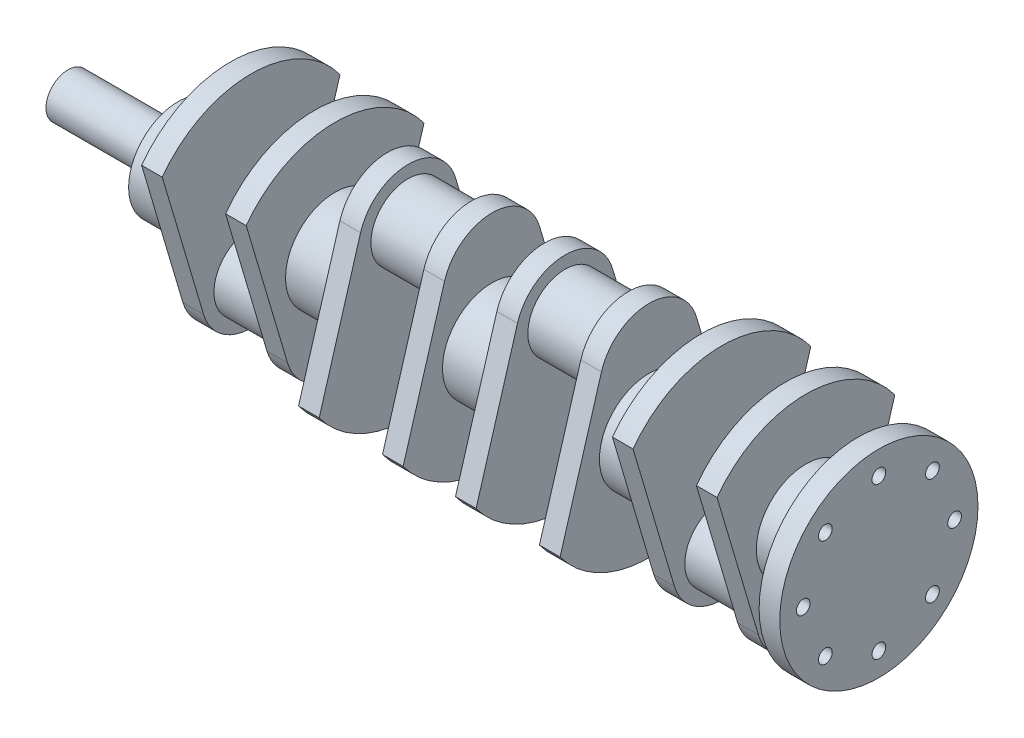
ISO-10303-21;
HEADER;
FILE_DESCRIPTION(('STEP AP214'),'2;1');
FILE_NAME('part.step','',(''),(''),'','','');
FILE_SCHEMA(('AUTOMOTIVE_DESIGN { 1 0 10303 214 1 1 1 1 }'));
ENDSEC;
DATA;
#1=APPLICATION_CONTEXT('core data for automotive mechanical design processes');
#2=APPLICATION_PROTOCOL_DEFINITION('international standard','automotive_design',2000,#1);
#3=PRODUCT_CONTEXT('',#1,'mechanical');
#4=PRODUCT('Part','Part','',(#3));
#5=PRODUCT_RELATED_PRODUCT_CATEGORY('part','',(#4));
#6=PRODUCT_DEFINITION_FORMATION('','',#4);
#7=PRODUCT_DEFINITION_CONTEXT('part definition',#1,'design');
#8=PRODUCT_DEFINITION('design','',#6,#7);
#9=PRODUCT_DEFINITION_SHAPE('','',#8);
#10=(LENGTH_UNIT() NAMED_UNIT(*) SI_UNIT(.MILLI.,.METRE.));
#11=(NAMED_UNIT(*) PLANE_ANGLE_UNIT() SI_UNIT($,.RADIAN.));
#12=(NAMED_UNIT(*) SI_UNIT($,.STERADIAN.) SOLID_ANGLE_UNIT());
#13=UNCERTAINTY_MEASURE_WITH_UNIT(LENGTH_MEASURE(1.E-05),#10,'distance_accuracy_value','');
#14=(GEOMETRIC_REPRESENTATION_CONTEXT(3) GLOBAL_UNCERTAINTY_ASSIGNED_CONTEXT((#13)) GLOBAL_UNIT_ASSIGNED_CONTEXT((#10,
#11,#12)) REPRESENTATION_CONTEXT('',''));
#15=CARTESIAN_POINT('',(0.,0.,0.));
#16=DIRECTION('',(0.,0.,1.));
#17=DIRECTION('',(1.,0.,0.));
#18=AXIS2_PLACEMENT_3D('',#15,#16,#17);
#19=CARTESIAN_POINT('',(0.,0.,0.));
#20=DIRECTION('',(-1.,0.,0.));
#21=DIRECTION('',(0.,0.,1.));
#22=AXIS2_PLACEMENT_3D('',#19,#20,#21);
#23=PLANE('',#22);
#24=CARTESIAN_POINT('',(0.,0.,0.));
#25=DIRECTION('',(-1.,0.,0.));
#26=DIRECTION('',(0.,0.,1.));
#27=AXIS2_PLACEMENT_3D('',#24,#25,#26);
#28=CIRCLE('',#27,72.);
#29=CARTESIAN_POINT('',(0.,0.,72.));
#30=VERTEX_POINT('',#29);
#31=EDGE_CURVE('E426',#30,#30,#28,.T.);
#32=ORIENTED_EDGE('',*,*,#31,.F.);
#33=EDGE_LOOP('',(#32));
#34=FACE_BOUND('',#33,.T.);
#35=CARTESIAN_POINT('',(1.2E-05,38.8908729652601,38.890872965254));
#36=DIRECTION('',(1.,0.,0.));
#37=DIRECTION('',(0.,0.,-1.));
#38=AXIS2_PLACEMENT_3D('',#35,#36,#37);
#39=CIRCLE('',#38,4.99999999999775);
#40=CARTESIAN_POINT('',(1.2E-05,38.8908729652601,33.8908729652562));
#41=VERTEX_POINT('',#40);
#42=EDGE_CURVE('E198',#41,#41,#39,.T.);
#43=ORIENTED_EDGE('',*,*,#42,.F.);
#44=EDGE_LOOP('',(#43));
#45=FACE_BOUND('',#44,.T.);
#46=CARTESIAN_POINT('',(1.2E-05,4.32753802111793E-12,54.9999999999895));
#47=DIRECTION('',(1.,0.,0.));
#48=DIRECTION('',(0.,0.,-1.));
#49=AXIS2_PLACEMENT_3D('',#46,#47,#48);
#50=CIRCLE('',#49,4.99999999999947);
#51=CARTESIAN_POINT('',(1.2E-05,4.32815034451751E-12,49.9999999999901));
#52=VERTEX_POINT('',#51);
#53=EDGE_CURVE('E305',#52,#52,#50,.T.);
#54=ORIENTED_EDGE('',*,*,#53,.F.);
#55=EDGE_LOOP('',(#54));
#56=FACE_BOUND('',#55,.T.);
#57=CARTESIAN_POINT('',(1.2E-05,-38.8908729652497,38.8908729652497));
#58=DIRECTION('',(1.,0.,0.));
#59=DIRECTION('',(0.,0.,-1.));
#60=AXIS2_PLACEMENT_3D('',#57,#58,#59);
#61=CIRCLE('',#60,5.00000000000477);
#62=CARTESIAN_POINT('',(1.2E-05,-38.8908729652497,33.8908729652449));
#63=VERTEX_POINT('',#62);
#64=EDGE_CURVE('E296',#63,#63,#61,.T.);
#65=ORIENTED_EDGE('',*,*,#64,.F.);
#66=EDGE_LOOP('',(#65));
#67=FACE_BOUND('',#66,.T.);
#68=CARTESIAN_POINT('',(1.2E-05,-54.9999999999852,-6.12517464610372E-12));
#69=DIRECTION('',(1.,0.,0.));
#70=DIRECTION('',(0.,0.,-1.));
#71=AXIS2_PLACEMENT_3D('',#68,#69,#70);
#72=CIRCLE('',#71,5.00000000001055);
#73=CARTESIAN_POINT('',(1.2E-05,-54.9999999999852,-5.00000000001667));
#74=VERTEX_POINT('',#73);
#75=EDGE_CURVE('E295',#74,#74,#72,.T.);
#76=ORIENTED_EDGE('',*,*,#75,.F.);
#77=EDGE_LOOP('',(#76));
#78=FACE_BOUND('',#77,.T.);
#79=CARTESIAN_POINT('',(1.2E-05,-38.8908729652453,-38.8908729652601));
#80=DIRECTION('',(1.,0.,0.));
#81=DIRECTION('',(0.,0.,-1.));
#82=AXIS2_PLACEMENT_3D('',#79,#80,#81);
#83=CIRCLE('',#82,5.00000000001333);
#84=CARTESIAN_POINT('',(1.2E-05,-38.8908729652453,-43.8908729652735));
#85=VERTEX_POINT('',#84);
#86=EDGE_CURVE('E290',#85,#85,#83,.T.);
#87=ORIENTED_EDGE('',*,*,#86,.F.);
#88=EDGE_LOOP('',(#87));
#89=FACE_BOUND('',#88,.T.);
#90=CARTESIAN_POINT('',(1.2E-05,1.0459448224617E-11,-54.9999999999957));
#91=DIRECTION('',(1.,0.,0.));
#92=DIRECTION('',(0.,0.,-1.));
#93=AXIS2_PLACEMENT_3D('',#90,#91,#92);
#94=CIRCLE('',#93,5.00000000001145);
#95=CARTESIAN_POINT('',(1.2E-05,1.04600605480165E-11,-60.0000000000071));
#96=VERTEX_POINT('',#95);
#97=EDGE_CURVE('E286',#96,#96,#94,.T.);
#98=ORIENTED_EDGE('',*,*,#97,.F.);
#99=EDGE_LOOP('',(#98));
#100=FACE_BOUND('',#99,.T.);
#101=CARTESIAN_POINT('',(1.2E-05,38.8908729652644,-38.8908729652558));
#102=DIRECTION('',(1.,0.,0.));
#103=DIRECTION('',(0.,0.,-1.));
#104=AXIS2_PLACEMENT_3D('',#101,#102,#103);
#105=CIRCLE('',#104,5.);
#106=CARTESIAN_POINT('',(1.2E-05,38.8908729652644,-43.8908729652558));
#107=VERTEX_POINT('',#106);
#108=EDGE_CURVE('E259',#107,#107,#105,.T.);
#109=ORIENTED_EDGE('',*,*,#108,.F.);
#110=EDGE_LOOP('',(#109));
#111=FACE_BOUND('',#110,.T.);
#112=CARTESIAN_POINT('',(1.2E-05,55.,0.));
#113=DIRECTION('',(1.,0.,0.));
#114=DIRECTION('',(0.,0.,-1.));
#115=AXIS2_PLACEMENT_3D('',#112,#113,#114);
#116=CIRCLE('',#115,5.);
#117=CARTESIAN_POINT('',(1.2E-05,55.,-5.));
#118=VERTEX_POINT('',#117);
#119=EDGE_CURVE('E267',#118,#118,#116,.T.);
#120=ORIENTED_EDGE('',*,*,#119,.F.);
#121=EDGE_LOOP('',(#120));
#122=FACE_BOUND('',#121,.T.);
#123=ADVANCED_FACE('F51',(#34,#45,#56,#67,#78,#89,#100,#111,#122),#23,.F.);
#124=CARTESIAN_POINT('',(-53.,0.,0.));
#125=DIRECTION('',(1.,0.,0.));
#126=DIRECTION('',(0.,0.,-1.));
#127=AXIS2_PLACEMENT_3D('',#124,#125,#126);
#128=PLANE('',#127);
#129=CARTESIAN_POINT('',(-53.,-44.,0.));
#130=DIRECTION('',(1.,0.,0.));
#131=DIRECTION('',(0.,0.,-1.));
#132=AXIS2_PLACEMENT_3D('',#129,#130,#131);
#133=CIRCLE('',#132,36.);
#134=CARTESIAN_POINT('',(-53.,-54.2245524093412,34.5175104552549));
#135=VERTEX_POINT('',#134);
#136=CARTESIAN_POINT('',(-53.,-54.2245524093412,-34.5175104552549));
#137=VERTEX_POINT('',#136);
#138=EDGE_CURVE('E143',#135,#137,#133,.T.);
#139=ORIENTED_EDGE('',*,*,#138,.T.);
#140=DIRECTION('',(0.,-0.958819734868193,0.284015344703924));
#141=VECTOR('',#140,1.);
#142=CARTESIAN_POINT('',(-53.,-13.7737999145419,-46.4995692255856));
#143=LINE('',#142,#141);
#144=CARTESIAN_POINT('',(-53.,47.2305923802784,-64.5698934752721));
#145=VERTEX_POINT('',#144);
#146=EDGE_CURVE('E153',#145,#137,#143,.T.);
#147=ORIENTED_EDGE('',*,*,#146,.F.);
#148=CARTESIAN_POINT('',(-53.,0.,0.));
#149=DIRECTION('',(1.,0.,0.));
#150=DIRECTION('',(0.,0.,-1.));
#151=AXIS2_PLACEMENT_3D('',#148,#149,#150);
#152=CIRCLE('',#151,80.);
#153=CARTESIAN_POINT('',(-53.,47.2305923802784,64.5698934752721));
#154=VERTEX_POINT('',#153);
#155=EDGE_CURVE('E157',#154,#145,#152,.F.);
#156=ORIENTED_EDGE('',*,*,#155,.F.);
#157=DIRECTION('',(0.,-0.958819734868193,-0.284015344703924));
#158=VECTOR('',#157,1.);
#159=CARTESIAN_POINT('',(-53.,-13.7737999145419,46.4995692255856));
#160=LINE('',#159,#158);
#161=EDGE_CURVE('E149',#154,#135,#160,.T.);
#162=ORIENTED_EDGE('',*,*,#161,.T.);
#163=EDGE_LOOP('',(#139,#147,#156,#162));
#164=FACE_BOUND('',#163,.T.);
#165=CARTESIAN_POINT('',(-53.,0.,0.));
#166=DIRECTION('',(-1.,0.,0.));
#167=DIRECTION('',(0.,0.,1.));
#168=AXIS2_PLACEMENT_3D('',#165,#166,#167);
#169=CIRCLE('',#168,36.);
#170=CARTESIAN_POINT('',(-53.,0.,36.));
#171=VERTEX_POINT('',#170);
#172=EDGE_CURVE('E270',#171,#171,#169,.T.);
#173=ORIENTED_EDGE('',*,*,#172,.T.);
#174=EDGE_LOOP('',(#173));
#175=FACE_BOUND('',#174,.T.);
#176=ADVANCED_FACE('F213',(#164,#175),#128,.T.);
#177=CARTESIAN_POINT('',(0.,0.,0.));
#178=DIRECTION('',(-1.,0.,0.));
#179=DIRECTION('',(0.,0.,1.));
#180=AXIS2_PLACEMENT_3D('',#177,#178,#179);
#181=CYLINDRICAL_SURFACE('',#180,35.9999999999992);
#182=CARTESIAN_POINT('',(-167.,0.,0.));
#183=DIRECTION('',(-1.,0.,0.));
#184=DIRECTION('',(0.,0.,1.));
#185=AXIS2_PLACEMENT_3D('',#182,#183,#184);
#186=CIRCLE('',#185,35.9999999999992);
#187=CARTESIAN_POINT('',(-167.,0.,35.9999999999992));
#188=VERTEX_POINT('',#187);
#189=EDGE_CURVE('E12',#188,#188,#186,.T.);
#190=ORIENTED_EDGE('',*,*,#189,.F.);
#191=EDGE_LOOP('',(#190));
#192=FACE_BOUND('',#191,.T.);
#193=CARTESIAN_POINT('',(-129.,0.,0.));
#194=DIRECTION('',(-1.,0.,0.));
#195=DIRECTION('',(0.,0.,1.));
#196=AXIS2_PLACEMENT_3D('',#193,#194,#195);
#197=CIRCLE('',#196,35.9999999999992);
#198=CARTESIAN_POINT('',(-129.,0.,35.9999999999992));
#199=VERTEX_POINT('',#198);
#200=EDGE_CURVE('E61',#199,#199,#197,.T.);
#201=ORIENTED_EDGE('',*,*,#200,.T.);
#202=EDGE_LOOP('',(#201));
#203=FACE_BOUND('',#202,.T.);
#204=ADVANCED_FACE('F52',(#192,#203),#181,.T.);
#205=CARTESIAN_POINT('',(-167.,0.,0.));
#206=DIRECTION('',(1.,0.,0.));
#207=DIRECTION('',(0.,0.,-1.));
#208=AXIS2_PLACEMENT_3D('',#205,#206,#207);
#209=PLANE('',#208);
#210=ORIENTED_EDGE('',*,*,#189,.T.);
#211=EDGE_LOOP('',(#210));
#212=FACE_BOUND('',#211,.T.);
#213=ADVANCED_FACE('F653',(#212),#209,.F.);
#214=CARTESIAN_POINT('',(-114.,-44.,0.));
#215=DIRECTION('',(-1.,0.,0.));
#216=DIRECTION('',(0.,0.,1.));
#217=AXIS2_PLACEMENT_3D('',#214,#215,#216);
#218=CYLINDRICAL_SURFACE('',#217,36.);
#219=CARTESIAN_POINT('',(-129.,-44.,0.));
#220=DIRECTION('',(1.,0.,0.));
#221=DIRECTION('',(0.,0.,-1.));
#222=AXIS2_PLACEMENT_3D('',#219,#220,#221);
#223=CIRCLE('',#222,36.);
#224=CARTESIAN_POINT('',(-129.,-54.2245524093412,34.5175104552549));
#225=VERTEX_POINT('',#224);
#226=CARTESIAN_POINT('',(-129.,-54.2245524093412,-34.5175104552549));
#227=VERTEX_POINT('',#226);
#228=EDGE_CURVE('E70',#225,#227,#223,.T.);
#229=ORIENTED_EDGE('',*,*,#228,.T.);
#230=DIRECTION('',(-1.,0.,0.));
#231=VECTOR('',#230,1.);
#232=CARTESIAN_POINT('',(-114.,-54.2245524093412,-34.5175104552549));
#233=LINE('',#232,#231);
#234=CARTESIAN_POINT('',(-114.,-54.2245524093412,-34.5175104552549));
#235=VERTEX_POINT('',#234);
#236=EDGE_CURVE('E188',#235,#227,#233,.T.);
#237=ORIENTED_EDGE('',*,*,#236,.F.);
#238=CARTESIAN_POINT('',(-114.,-44.,0.));
#239=DIRECTION('',(1.,0.,0.));
#240=DIRECTION('',(0.,0.,-1.));
#241=AXIS2_PLACEMENT_3D('',#238,#239,#240);
#242=CIRCLE('',#241,36.);
#243=CARTESIAN_POINT('',(-114.,-54.2245524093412,34.5175104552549));
#244=VERTEX_POINT('',#243);
#245=EDGE_CURVE('E164',#244,#235,#242,.T.);
#246=ORIENTED_EDGE('',*,*,#245,.F.);
#247=DIRECTION('',(-1.,0.,0.));
#248=VECTOR('',#247,1.);
#249=CARTESIAN_POINT('',(-114.,-54.2245524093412,34.5175104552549));
#250=LINE('',#249,#248);
#251=EDGE_CURVE('E178',#244,#225,#250,.T.);
#252=ORIENTED_EDGE('',*,*,#251,.T.);
#253=EDGE_LOOP('',(#229,#237,#246,#252));
#254=FACE_BOUND('',#253,.T.);
#255=ADVANCED_FACE('F643',(#254),#218,.T.);
#256=CARTESIAN_POINT('',(-114.,-13.7737999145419,-46.4995692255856));
#257=DIRECTION('',(0.,-0.284015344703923,-0.958819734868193));
#258=DIRECTION('',(0.,0.958819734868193,-0.284015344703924));
#259=AXIS2_PLACEMENT_3D('',#256,#257,#258);
#260=PLANE('',#259);
#261=DIRECTION('',(0.,-0.958819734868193,0.284015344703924));
#262=VECTOR('',#261,1.);
#263=CARTESIAN_POINT('',(-129.,-13.7737999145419,-46.4995692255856));
#264=LINE('',#263,#262);
#265=CARTESIAN_POINT('',(-129.,47.2305923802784,-64.5698934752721));
#266=VERTEX_POINT('',#265);
#267=EDGE_CURVE('E184',#266,#227,#264,.T.);
#268=ORIENTED_EDGE('',*,*,#267,.F.);
#269=DIRECTION('',(-1.,0.,0.));
#270=VECTOR('',#269,1.);
#271=CARTESIAN_POINT('',(-114.,47.2305923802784,-64.5698934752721));
#272=LINE('',#271,#270);
#273=CARTESIAN_POINT('',(-114.,47.2305923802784,-64.5698934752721));
#274=VERTEX_POINT('',#273);
#275=EDGE_CURVE('E190',#274,#266,#272,.T.);
#276=ORIENTED_EDGE('',*,*,#275,.F.);
#277=DIRECTION('',(0.,-0.958819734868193,0.284015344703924));
#278=VECTOR('',#277,1.);
#279=CARTESIAN_POINT('',(-114.,-13.7737999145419,-46.4995692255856));
#280=LINE('',#279,#278);
#281=EDGE_CURVE('E170',#274,#235,#280,.T.);
#282=ORIENTED_EDGE('',*,*,#281,.T.);
#283=ORIENTED_EDGE('',*,*,#236,.T.);
#284=EDGE_LOOP('',(#268,#276,#282,#283));
#285=FACE_BOUND('',#284,.T.);
#286=ADVANCED_FACE('F636',(#285),#260,.T.);
#287=CARTESIAN_POINT('',(-114.,0.,0.));
#288=DIRECTION('',(-1.,0.,0.));
#289=DIRECTION('',(0.,0.,1.));
#290=AXIS2_PLACEMENT_3D('',#287,#288,#289);
#291=CYLINDRICAL_SURFACE('',#290,80.);
#292=CARTESIAN_POINT('',(-129.,0.,0.));
#293=DIRECTION('',(1.,0.,0.));
#294=DIRECTION('',(0.,0.,-1.));
#295=AXIS2_PLACEMENT_3D('',#292,#293,#294);
#296=CIRCLE('',#295,80.);
#297=CARTESIAN_POINT('',(-129.,47.2305923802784,64.5698934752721));
#298=VERTEX_POINT('',#297);
#299=EDGE_CURVE('E80',#298,#266,#296,.F.);
#300=ORIENTED_EDGE('',*,*,#299,.F.);
#301=DIRECTION('',(-1.,0.,0.));
#302=VECTOR('',#301,1.);
#303=CARTESIAN_POINT('',(-114.,47.2305923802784,64.5698934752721));
#304=LINE('',#303,#302);
#305=CARTESIAN_POINT('',(-114.,47.2305923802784,64.5698934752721));
#306=VERTEX_POINT('',#305);
#307=EDGE_CURVE('E179',#306,#298,#304,.T.);
#308=ORIENTED_EDGE('',*,*,#307,.F.);
#309=CARTESIAN_POINT('',(-114.,0.,0.));
#310=DIRECTION('',(1.,0.,0.));
#311=DIRECTION('',(0.,0.,-1.));
#312=AXIS2_PLACEMENT_3D('',#309,#310,#311);
#313=CIRCLE('',#312,80.);
#314=EDGE_CURVE('E167',#306,#274,#313,.F.);
#315=ORIENTED_EDGE('',*,*,#314,.T.);
#316=ORIENTED_EDGE('',*,*,#275,.T.);
#317=EDGE_LOOP('',(#300,#308,#315,#316));
#318=FACE_BOUND('',#317,.T.);
#319=ADVANCED_FACE('F626',(#318),#291,.T.);
#320=CARTESIAN_POINT('',(-129.,0.,0.));
#321=DIRECTION('',(1.,0.,0.));
#322=DIRECTION('',(0.,0.,-1.));
#323=AXIS2_PLACEMENT_3D('',#320,#321,#322);
#324=PLANE('',#323);
#325=ORIENTED_EDGE('',*,*,#200,.F.);
#326=EDGE_LOOP('',(#325));
#327=FACE_BOUND('',#326,.T.);
#328=ORIENTED_EDGE('',*,*,#228,.F.);
#329=DIRECTION('',(0.,-0.958819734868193,-0.284015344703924));
#330=VECTOR('',#329,1.);
#331=CARTESIAN_POINT('',(-129.,-13.7737999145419,46.4995692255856));
#332=LINE('',#331,#330);
#333=EDGE_CURVE('E176',#298,#225,#332,.T.);
#334=ORIENTED_EDGE('',*,*,#333,.F.);
#335=ORIENTED_EDGE('',*,*,#299,.T.);
#336=ORIENTED_EDGE('',*,*,#267,.T.);
#337=EDGE_LOOP('',(#328,#334,#335,#336));
#338=FACE_BOUND('',#337,.T.);
#339=ADVANCED_FACE('F618',(#327,#338),#324,.F.);
#340=CARTESIAN_POINT('',(-114.,-13.7737999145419,46.4995692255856));
#341=DIRECTION('',(0.,0.284015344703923,-0.958819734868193));
#342=DIRECTION('',(0.,0.958819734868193,0.284015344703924));
#343=AXIS2_PLACEMENT_3D('',#340,#341,#342);
#344=PLANE('',#343);
#345=ORIENTED_EDGE('',*,*,#333,.T.);
#346=ORIENTED_EDGE('',*,*,#251,.F.);
#347=DIRECTION('',(0.,-0.958819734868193,-0.284015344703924));
#348=VECTOR('',#347,1.);
#349=CARTESIAN_POINT('',(-114.,-13.7737999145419,46.4995692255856));
#350=LINE('',#349,#348);
#351=EDGE_CURVE('E173',#306,#244,#350,.T.);
#352=ORIENTED_EDGE('',*,*,#351,.F.);
#353=ORIENTED_EDGE('',*,*,#307,.T.);
#354=EDGE_LOOP('',(#345,#346,#352,#353));
#355=FACE_BOUND('',#354,.T.);
#356=ADVANCED_FACE('F606',(#355),#344,.F.);
#357=CARTESIAN_POINT('',(-114.,0.,0.));
#358=DIRECTION('',(1.,0.,0.));
#359=DIRECTION('',(0.,0.,-1.));
#360=AXIS2_PLACEMENT_3D('',#357,#358,#359);
#361=PLANE('',#360);
#362=CARTESIAN_POINT('',(-114.,-44.,0.));
#363=DIRECTION('',(1.,0.,0.));
#364=DIRECTION('',(0.,0.,-1.));
#365=AXIS2_PLACEMENT_3D('',#362,#363,#364);
#366=CIRCLE('',#365,27.);
#367=CARTESIAN_POINT('',(-114.,-44.,-27.));
#368=VERTEX_POINT('',#367);
#369=EDGE_CURVE('E132',#368,#368,#366,.T.);
#370=ORIENTED_EDGE('',*,*,#369,.F.);
#371=EDGE_LOOP('',(#370));
#372=FACE_BOUND('',#371,.T.);
#373=ORIENTED_EDGE('',*,*,#245,.T.);
#374=ORIENTED_EDGE('',*,*,#281,.F.);
#375=ORIENTED_EDGE('',*,*,#314,.F.);
#376=ORIENTED_EDGE('',*,*,#351,.T.);
#377=EDGE_LOOP('',(#373,#374,#375,#376));
#378=FACE_BOUND('',#377,.T.);
#379=ADVANCED_FACE('F600',(#372,#378),#361,.T.);
#380=CARTESIAN_POINT('',(-53.,-44.,0.));
#381=DIRECTION('',(-1.,0.,0.));
#382=DIRECTION('',(0.,0.,1.));
#383=AXIS2_PLACEMENT_3D('',#380,#381,#382);
#384=CYLINDRICAL_SURFACE('',#383,36.);
#385=CARTESIAN_POINT('',(-68.,-44.,0.));
#386=DIRECTION('',(1.,0.,0.));
#387=DIRECTION('',(0.,0.,-1.));
#388=AXIS2_PLACEMENT_3D('',#385,#386,#387);
#389=CIRCLE('',#388,36.);
#390=CARTESIAN_POINT('',(-68.,-54.2245524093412,34.5175104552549));
#391=VERTEX_POINT('',#390);
#392=CARTESIAN_POINT('',(-68.,-54.2245524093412,-34.5175104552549));
#393=VERTEX_POINT('',#392);
#394=EDGE_CURVE('E122',#391,#393,#389,.T.);
#395=ORIENTED_EDGE('',*,*,#394,.T.);
#396=DIRECTION('',(-1.,0.,0.));
#397=VECTOR('',#396,1.);
#398=CARTESIAN_POINT('',(-53.,-54.2245524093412,-34.5175104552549));
#399=LINE('',#398,#397);
#400=EDGE_CURVE('E161',#137,#393,#399,.T.);
#401=ORIENTED_EDGE('',*,*,#400,.F.);
#402=ORIENTED_EDGE('',*,*,#138,.F.);
#403=DIRECTION('',(-1.,0.,0.));
#404=VECTOR('',#403,1.);
#405=CARTESIAN_POINT('',(-53.,-54.2245524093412,34.5175104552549));
#406=LINE('',#405,#404);
#407=EDGE_CURVE('E137',#135,#391,#406,.T.);
#408=ORIENTED_EDGE('',*,*,#407,.T.);
#409=EDGE_LOOP('',(#395,#401,#402,#408));
#410=FACE_BOUND('',#409,.T.);
#411=ADVANCED_FACE('F144',(#410),#384,.T.);
#412=CARTESIAN_POINT('',(-53.,-13.7737999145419,-46.4995692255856));
#413=DIRECTION('',(0.,-0.284015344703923,-0.958819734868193));
#414=DIRECTION('',(0.,0.958819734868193,-0.284015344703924));
#415=AXIS2_PLACEMENT_3D('',#412,#413,#414);
#416=PLANE('',#415);
#417=DIRECTION('',(0.,-0.958819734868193,0.284015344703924));
#418=VECTOR('',#417,1.);
#419=CARTESIAN_POINT('',(-68.,-13.7737999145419,-46.4995692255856));
#420=LINE('',#419,#418);
#421=CARTESIAN_POINT('',(-68.,47.2305923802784,-64.5698934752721));
#422=VERTEX_POINT('',#421);
#423=EDGE_CURVE('E126',#422,#393,#420,.T.);
#424=ORIENTED_EDGE('',*,*,#423,.F.);
#425=DIRECTION('',(-1.,0.,0.));
#426=VECTOR('',#425,1.);
#427=CARTESIAN_POINT('',(-53.,47.2305923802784,-64.5698934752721));
#428=LINE('',#427,#426);
#429=EDGE_CURVE('E160',#145,#422,#428,.T.);
#430=ORIENTED_EDGE('',*,*,#429,.F.);
#431=ORIENTED_EDGE('',*,*,#146,.T.);
#432=ORIENTED_EDGE('',*,*,#400,.T.);
#433=EDGE_LOOP('',(#424,#430,#431,#432));
#434=FACE_BOUND('',#433,.T.);
#435=ADVANCED_FACE('F438',(#434),#416,.T.);
#436=CARTESIAN_POINT('',(-53.,0.,0.));
#437=DIRECTION('',(-1.,0.,0.));
#438=DIRECTION('',(0.,0.,1.));
#439=AXIS2_PLACEMENT_3D('',#436,#437,#438);
#440=CYLINDRICAL_SURFACE('',#439,80.);
#441=CARTESIAN_POINT('',(-68.,0.,0.));
#442=DIRECTION('',(1.,0.,0.));
#443=DIRECTION('',(0.,0.,-1.));
#444=AXIS2_PLACEMENT_3D('',#441,#442,#443);
#445=CIRCLE('',#444,80.);
#446=CARTESIAN_POINT('',(-68.,47.2305923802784,64.5698934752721));
#447=VERTEX_POINT('',#446);
#448=EDGE_CURVE('E142',#447,#422,#445,.F.);
#449=ORIENTED_EDGE('',*,*,#448,.F.);
#450=DIRECTION('',(-1.,0.,0.));
#451=VECTOR('',#450,1.);
#452=CARTESIAN_POINT('',(-53.,47.2305923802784,64.5698934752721));
#453=LINE('',#452,#451);
#454=EDGE_CURVE('E140',#154,#447,#453,.T.);
#455=ORIENTED_EDGE('',*,*,#454,.F.);
#456=ORIENTED_EDGE('',*,*,#155,.T.);
#457=ORIENTED_EDGE('',*,*,#429,.T.);
#458=EDGE_LOOP('',(#449,#455,#456,#457));
#459=FACE_BOUND('',#458,.T.);
#460=ADVANCED_FACE('F437',(#459),#440,.T.);
#461=CARTESIAN_POINT('',(-53.,-13.7737999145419,46.4995692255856));
#462=DIRECTION('',(0.,0.284015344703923,-0.958819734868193));
#463=DIRECTION('',(0.,0.958819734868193,0.284015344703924));
#464=AXIS2_PLACEMENT_3D('',#461,#462,#463);
#465=PLANE('',#464);
#466=DIRECTION('',(0.,-0.958819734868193,-0.284015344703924));
#467=VECTOR('',#466,1.);
#468=CARTESIAN_POINT('',(-68.,-13.7737999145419,46.4995692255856));
#469=LINE('',#468,#467);
#470=EDGE_CURVE('E121',#447,#391,#469,.T.);
#471=ORIENTED_EDGE('',*,*,#470,.T.);
#472=ORIENTED_EDGE('',*,*,#407,.F.);
#473=ORIENTED_EDGE('',*,*,#161,.F.);
#474=ORIENTED_EDGE('',*,*,#454,.T.);
#475=EDGE_LOOP('',(#471,#472,#473,#474));
#476=FACE_BOUND('',#475,.T.);
#477=ADVANCED_FACE('F136',(#476),#465,.F.);
#478=CARTESIAN_POINT('',(-68.,0.,0.));
#479=DIRECTION('',(1.,0.,0.));
#480=DIRECTION('',(0.,0.,-1.));
#481=AXIS2_PLACEMENT_3D('',#478,#479,#480);
#482=PLANE('',#481);
#483=CARTESIAN_POINT('',(-68.,-44.,0.));
#484=DIRECTION('',(1.,0.,0.));
#485=DIRECTION('',(0.,0.,-1.));
#486=AXIS2_PLACEMENT_3D('',#483,#484,#485);
#487=CIRCLE('',#486,27.);
#488=CARTESIAN_POINT('',(-68.,-44.,-27.));
#489=VERTEX_POINT('',#488);
#490=EDGE_CURVE('E431',#489,#489,#487,.T.);
#491=ORIENTED_EDGE('',*,*,#490,.T.);
#492=EDGE_LOOP('',(#491));
#493=FACE_BOUND('',#492,.T.);
#494=ORIENTED_EDGE('',*,*,#394,.F.);
#495=ORIENTED_EDGE('',*,*,#470,.F.);
#496=ORIENTED_EDGE('',*,*,#448,.T.);
#497=ORIENTED_EDGE('',*,*,#423,.T.);
#498=EDGE_LOOP('',(#494,#495,#496,#497));
#499=FACE_BOUND('',#498,.T.);
#500=ADVANCED_FACE('F124',(#493,#499),#482,.F.);
#501=CARTESIAN_POINT('',(-68.,-44.,0.));
#502=DIRECTION('',(-1.,0.,0.));
#503=DIRECTION('',(0.,0.,1.));
#504=AXIS2_PLACEMENT_3D('',#501,#502,#503);
#505=CYLINDRICAL_SURFACE('',#504,27.);
#506=ORIENTED_EDGE('',*,*,#490,.F.);
#507=EDGE_LOOP('',(#506));
#508=FACE_BOUND('',#507,.T.);
#509=ORIENTED_EDGE('',*,*,#369,.T.);
#510=EDGE_LOOP('',(#509));
#511=FACE_BOUND('',#510,.T.);
#512=ADVANCED_FACE('F219',(#508,#511),#505,.T.);
#513=CARTESIAN_POINT('',(0.,0.,0.));
#514=DIRECTION('',(-1.,0.,0.));
#515=DIRECTION('',(0.,0.,1.));
#516=AXIS2_PLACEMENT_3D('',#513,#514,#515);
#517=CYLINDRICAL_SURFACE('',#516,72.);
#518=CARTESIAN_POINT('',(-15.,0.,0.));
#519=DIRECTION('',(-1.,0.,0.));
#520=DIRECTION('',(0.,0.,1.));
#521=AXIS2_PLACEMENT_3D('',#518,#519,#520);
#522=CIRCLE('',#521,72.);
#523=CARTESIAN_POINT('',(-15.,0.,72.));
#524=VERTEX_POINT('',#523);
#525=EDGE_CURVE('E424',#524,#524,#522,.T.);
#526=ORIENTED_EDGE('',*,*,#525,.F.);
#527=EDGE_LOOP('',(#526));
#528=FACE_BOUND('',#527,.T.);
#529=ORIENTED_EDGE('',*,*,#31,.T.);
#530=EDGE_LOOP('',(#529));
#531=FACE_BOUND('',#530,.T.);
#532=ADVANCED_FACE('F216',(#528,#531),#517,.T.);
#533=CARTESIAN_POINT('',(-15.,0.,0.));
#534=DIRECTION('',(1.,0.,0.));
#535=DIRECTION('',(0.,0.,-1.));
#536=AXIS2_PLACEMENT_3D('',#533,#534,#535);
#537=PLANE('',#536);
#538=CARTESIAN_POINT('',(-15.,55.,0.));
#539=DIRECTION('',(1.,0.,0.));
#540=DIRECTION('',(0.,0.,-1.));
#541=AXIS2_PLACEMENT_3D('',#538,#539,#540);
#542=CIRCLE('',#541,5.);
#543=CARTESIAN_POINT('',(-15.,55.,-5.));
#544=VERTEX_POINT('',#543);
#545=EDGE_CURVE('E272',#544,#544,#542,.F.);
#546=ORIENTED_EDGE('',*,*,#545,.F.);
#547=EDGE_LOOP('',(#546));
#548=FACE_BOUND('',#547,.T.);
#549=CARTESIAN_POINT('',(-15.,38.8908729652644,-38.8908729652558));
#550=DIRECTION('',(1.,0.,0.));
#551=DIRECTION('',(0.,0.,-1.));
#552=AXIS2_PLACEMENT_3D('',#549,#550,#551);
#553=CIRCLE('',#552,5.);
#554=CARTESIAN_POINT('',(-15.,38.8908729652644,-43.8908729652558));
#555=VERTEX_POINT('',#554);
#556=EDGE_CURVE('E279',#555,#555,#553,.F.);
#557=ORIENTED_EDGE('',*,*,#556,.F.);
#558=EDGE_LOOP('',(#557));
#559=FACE_BOUND('',#558,.T.);
#560=CARTESIAN_POINT('',(-15.,1.0459448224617E-11,-54.9999999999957));
#561=DIRECTION('',(1.,0.,0.));
#562=DIRECTION('',(0.,0.,-1.));
#563=AXIS2_PLACEMENT_3D('',#560,#561,#562);
#564=CIRCLE('',#563,5.00000000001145);
#565=CARTESIAN_POINT('',(-15.,1.0459448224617E-11,-60.0000000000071));
#566=VERTEX_POINT('',#565);
#567=EDGE_CURVE('E284',#566,#566,#564,.F.);
#568=ORIENTED_EDGE('',*,*,#567,.F.);
#569=EDGE_LOOP('',(#568));
#570=FACE_BOUND('',#569,.T.);
#571=CARTESIAN_POINT('',(-15.,-38.8908729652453,-38.8908729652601));
#572=DIRECTION('',(1.,0.,0.));
#573=DIRECTION('',(0.,0.,-1.));
#574=AXIS2_PLACEMENT_3D('',#571,#572,#573);
#575=CIRCLE('',#574,5.00000000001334);
#576=CARTESIAN_POINT('',(-15.,-38.8908729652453,-43.8908729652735));
#577=VERTEX_POINT('',#576);
#578=EDGE_CURVE('E287',#577,#577,#575,.F.);
#579=ORIENTED_EDGE('',*,*,#578,.F.);
#580=EDGE_LOOP('',(#579));
#581=FACE_BOUND('',#580,.T.);
#582=CARTESIAN_POINT('',(-15.,-54.9999999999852,-6.12517464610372E-12));
#583=DIRECTION('',(1.,0.,0.));
#584=DIRECTION('',(0.,0.,-1.));
#585=AXIS2_PLACEMENT_3D('',#582,#583,#584);
#586=CIRCLE('',#585,5.00000000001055);
#587=CARTESIAN_POINT('',(-15.,-54.9999999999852,-5.00000000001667));
#588=VERTEX_POINT('',#587);
#589=EDGE_CURVE('E293',#588,#588,#586,.F.);
#590=ORIENTED_EDGE('',*,*,#589,.F.);
#591=EDGE_LOOP('',(#590));
#592=FACE_BOUND('',#591,.T.);
#593=CARTESIAN_POINT('',(-15.,-38.8908729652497,38.8908729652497));
#594=DIRECTION('',(1.,0.,0.));
#595=DIRECTION('',(0.,0.,-1.));
#596=AXIS2_PLACEMENT_3D('',#593,#594,#595);
#597=CIRCLE('',#596,5.00000000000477);
#598=CARTESIAN_POINT('',(-15.,-38.8908729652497,33.8908729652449));
#599=VERTEX_POINT('',#598);
#600=EDGE_CURVE('E294',#599,#599,#597,.F.);
#601=ORIENTED_EDGE('',*,*,#600,.F.);
#602=EDGE_LOOP('',(#601));
#603=FACE_BOUND('',#602,.T.);
#604=CARTESIAN_POINT('',(-15.,4.32753802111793E-12,54.9999999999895));
#605=DIRECTION('',(1.,0.,0.));
#606=DIRECTION('',(0.,0.,-1.));
#607=AXIS2_PLACEMENT_3D('',#604,#605,#606);
#608=CIRCLE('',#607,4.99999999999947);
#609=CARTESIAN_POINT('',(-15.,4.32753802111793E-12,49.9999999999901));
#610=VERTEX_POINT('',#609);
#611=EDGE_CURVE('E299',#610,#610,#608,.F.);
#612=ORIENTED_EDGE('',*,*,#611,.F.);
#613=EDGE_LOOP('',(#612));
#614=FACE_BOUND('',#613,.T.);
#615=CARTESIAN_POINT('',(-15.,38.8908729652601,38.890872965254));
#616=DIRECTION('',(1.,0.,0.));
#617=DIRECTION('',(0.,0.,-1.));
#618=AXIS2_PLACEMENT_3D('',#615,#616,#617);
#619=CIRCLE('',#618,4.99999999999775);
#620=CARTESIAN_POINT('',(-15.,38.8908729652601,33.8908729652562));
#621=VERTEX_POINT('',#620);
#622=EDGE_CURVE('E303',#621,#621,#619,.F.);
#623=ORIENTED_EDGE('',*,*,#622,.F.);
#624=EDGE_LOOP('',(#623));
#625=FACE_BOUND('',#624,.T.);
#626=CARTESIAN_POINT('',(-15.,0.,0.));
#627=DIRECTION('',(-1.,0.,0.));
#628=DIRECTION('',(0.,0.,1.));
#629=AXIS2_PLACEMENT_3D('',#626,#627,#628);
#630=CIRCLE('',#629,36.);
#631=CARTESIAN_POINT('',(-15.,0.,36.));
#632=VERTEX_POINT('',#631);
#633=EDGE_CURVE('E271',#632,#632,#630,.T.);
#634=ORIENTED_EDGE('',*,*,#633,.F.);
#635=EDGE_LOOP('',(#634));
#636=FACE_BOUND('',#635,.T.);
#637=ORIENTED_EDGE('',*,*,#525,.T.);
#638=EDGE_LOOP('',(#637));
#639=FACE_BOUND('',#638,.T.);
#640=ADVANCED_FACE('F446',(#548,#559,#570,#581,#592,#603,#614,#625,#636,#639),#537,.F.);
#641=CARTESIAN_POINT('',(0.,0.,0.));
#642=DIRECTION('',(-1.,0.,0.));
#643=DIRECTION('',(0.,0.,1.));
#644=AXIS2_PLACEMENT_3D('',#641,#642,#643);
#645=CYLINDRICAL_SURFACE('',#644,36.);
#646=ORIENTED_EDGE('',*,*,#172,.F.);
#647=EDGE_LOOP('',(#646));
#648=FACE_BOUND('',#647,.T.);
#649=ORIENTED_EDGE('',*,*,#633,.T.);
#650=EDGE_LOOP('',(#649));
#651=FACE_BOUND('',#650,.T.);
#652=ADVANCED_FACE('F414',(#648,#651),#645,.T.);
#653=CARTESIAN_POINT('',(1.2E-05,38.8908729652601,38.890872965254));
#654=DIRECTION('',(-1.,0.,0.));
#655=DIRECTION('',(0.,0.,1.));
#656=AXIS2_PLACEMENT_3D('',#653,#654,#655);
#657=CYLINDRICAL_SURFACE('',#656,4.99999999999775);
#658=ORIENTED_EDGE('',*,*,#42,.T.);
#659=EDGE_LOOP('',(#658));
#660=FACE_BOUND('',#659,.T.);
#661=ORIENTED_EDGE('',*,*,#622,.T.);
#662=EDGE_LOOP('',(#661));
#663=FACE_BOUND('',#662,.T.);
#664=ADVANCED_FACE('F408',(#660,#663),#657,.F.);
#665=CARTESIAN_POINT('',(1.2E-05,4.32753802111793E-12,54.9999999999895));
#666=DIRECTION('',(-1.,0.,0.));
#667=DIRECTION('',(0.,0.,1.));
#668=AXIS2_PLACEMENT_3D('',#665,#666,#667);
#669=CYLINDRICAL_SURFACE('',#668,4.99999999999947);
#670=ORIENTED_EDGE('',*,*,#53,.T.);
#671=EDGE_LOOP('',(#670));
#672=FACE_BOUND('',#671,.T.);
#673=ORIENTED_EDGE('',*,*,#611,.T.);
#674=EDGE_LOOP('',(#673));
#675=FACE_BOUND('',#674,.T.);
#676=ADVANCED_FACE('F400',(#672,#675),#669,.F.);
#677=CARTESIAN_POINT('',(1.2E-05,-38.8908729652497,38.8908729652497));
#678=DIRECTION('',(-1.,0.,0.));
#679=DIRECTION('',(0.,0.,1.));
#680=AXIS2_PLACEMENT_3D('',#677,#678,#679);
#681=CYLINDRICAL_SURFACE('',#680,5.00000000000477);
#682=ORIENTED_EDGE('',*,*,#64,.T.);
#683=EDGE_LOOP('',(#682));
#684=FACE_BOUND('',#683,.T.);
#685=ORIENTED_EDGE('',*,*,#600,.T.);
#686=EDGE_LOOP('',(#685));
#687=FACE_BOUND('',#686,.T.);
#688=ADVANCED_FACE('F367',(#684,#687),#681,.F.);
#689=CARTESIAN_POINT('',(1.2E-05,-54.9999999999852,-6.12517464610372E-12));
#690=DIRECTION('',(-1.,0.,0.));
#691=DIRECTION('',(0.,0.,1.));
#692=AXIS2_PLACEMENT_3D('',#689,#690,#691);
#693=CYLINDRICAL_SURFACE('',#692,5.00000000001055);
#694=ORIENTED_EDGE('',*,*,#75,.T.);
#695=EDGE_LOOP('',(#694));
#696=FACE_BOUND('',#695,.T.);
#697=ORIENTED_EDGE('',*,*,#589,.T.);
#698=EDGE_LOOP('',(#697));
#699=FACE_BOUND('',#698,.T.);
#700=ADVANCED_FACE('F362',(#696,#699),#693,.F.);
#701=CARTESIAN_POINT('',(1.2E-05,-38.8908729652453,-38.8908729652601));
#702=DIRECTION('',(-1.,0.,0.));
#703=DIRECTION('',(0.,0.,1.));
#704=AXIS2_PLACEMENT_3D('',#701,#702,#703);
#705=CYLINDRICAL_SURFACE('',#704,5.00000000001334);
#706=ORIENTED_EDGE('',*,*,#86,.T.);
#707=EDGE_LOOP('',(#706));
#708=FACE_BOUND('',#707,.T.);
#709=ORIENTED_EDGE('',*,*,#578,.T.);
#710=EDGE_LOOP('',(#709));
#711=FACE_BOUND('',#710,.T.);
#712=ADVANCED_FACE('F358',(#708,#711),#705,.F.);
#713=CARTESIAN_POINT('',(1.2E-05,1.0459448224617E-11,-54.9999999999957));
#714=DIRECTION('',(-1.,0.,0.));
#715=DIRECTION('',(0.,0.,1.));
#716=AXIS2_PLACEMENT_3D('',#713,#714,#715);
#717=CYLINDRICAL_SURFACE('',#716,5.00000000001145);
#718=ORIENTED_EDGE('',*,*,#97,.T.);
#719=EDGE_LOOP('',(#718));
#720=FACE_BOUND('',#719,.T.);
#721=ORIENTED_EDGE('',*,*,#567,.T.);
#722=EDGE_LOOP('',(#721));
#723=FACE_BOUND('',#722,.T.);
#724=ADVANCED_FACE('F323',(#720,#723),#717,.F.);
#725=CARTESIAN_POINT('',(1.2E-05,38.8908729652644,-38.8908729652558));
#726=DIRECTION('',(-1.,0.,0.));
#727=DIRECTION('',(0.,0.,1.));
#728=AXIS2_PLACEMENT_3D('',#725,#726,#727);
#729=CYLINDRICAL_SURFACE('',#728,5.);
#730=ORIENTED_EDGE('',*,*,#108,.T.);
#731=EDGE_LOOP('',(#730));
#732=FACE_BOUND('',#731,.T.);
#733=ORIENTED_EDGE('',*,*,#556,.T.);
#734=EDGE_LOOP('',(#733));
#735=FACE_BOUND('',#734,.T.);
#736=ADVANCED_FACE('F318',(#732,#735),#729,.F.);
#737=CARTESIAN_POINT('',(1.2E-05,55.,0.));
#738=DIRECTION('',(-1.,0.,0.));
#739=DIRECTION('',(0.,0.,1.));
#740=AXIS2_PLACEMENT_3D('',#737,#738,#739);
#741=CYLINDRICAL_SURFACE('',#740,5.);
#742=ORIENTED_EDGE('',*,*,#119,.T.);
#743=EDGE_LOOP('',(#742));
#744=FACE_BOUND('',#743,.T.);
#745=ORIENTED_EDGE('',*,*,#545,.T.);
#746=EDGE_LOOP('',(#745));
#747=FACE_BOUND('',#746,.T.);
#748=ADVANCED_FACE('F311',(#744,#747),#741,.F.);
#749=CLOSED_SHELL('',(#123,#176,#204,#213,#255,#286,#319,#339,#356,#379,#411,#435,#460,#477,
#500,#512,#532,#640,#652,#664,#676,#688,#700,#712,#724,#736,#748));
#750=MANIFOLD_SOLID_BREP('B2',#749);
#751=CARTESIAN_POINT('',(0.,0.,0.));
#752=DIRECTION('',(-1.,0.,0.));
#753=DIRECTION('',(0.,0.,1.));
#754=AXIS2_PLACEMENT_3D('',#751,#752,#753);
#755=CYLINDRICAL_SURFACE('',#754,35.9999999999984);
#756=CARTESIAN_POINT('',(-281.,0.,0.));
#757=DIRECTION('',(-1.,0.,0.));
#758=DIRECTION('',(0.,0.,1.));
#759=AXIS2_PLACEMENT_3D('',#756,#757,#758);
#760=CIRCLE('',#759,35.9999999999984);
#761=CARTESIAN_POINT('',(-281.,0.,35.9999999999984));
#762=VERTEX_POINT('',#761);
#763=EDGE_CURVE('E780',#762,#762,#760,.T.);
#764=ORIENTED_EDGE('',*,*,#763,.F.);
#765=EDGE_LOOP('',(#764));
#766=FACE_BOUND('',#765,.T.);
#767=CARTESIAN_POINT('',(-243.,0.,0.));
#768=DIRECTION('',(-1.,0.,0.));
#769=DIRECTION('',(0.,0.,1.));
#770=AXIS2_PLACEMENT_3D('',#767,#768,#769);
#771=CIRCLE('',#770,35.9999999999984);
#772=CARTESIAN_POINT('',(-243.,0.,35.9999999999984));
#773=VERTEX_POINT('',#772);
#774=EDGE_CURVE('E775',#773,#773,#771,.T.);
#775=ORIENTED_EDGE('',*,*,#774,.T.);
#776=EDGE_LOOP('',(#775));
#777=FACE_BOUND('',#776,.T.);
#778=ADVANCED_FACE('F768',(#766,#777),#755,.T.);
#779=CARTESIAN_POINT('',(-281.,13.7737999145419,-46.4995692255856));
#780=DIRECTION('',(0.,-0.284015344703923,0.958819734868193));
#781=DIRECTION('',(0.,-0.958819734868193,-0.284015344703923));
#782=AXIS2_PLACEMENT_3D('',#779,#780,#781);
#783=PLANE('',#782);
#784=DIRECTION('',(0.,0.958819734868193,0.284015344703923));
#785=VECTOR('',#784,1.);
#786=CARTESIAN_POINT('',(-296.,13.7737999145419,-46.4995692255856));
#787=LINE('',#786,#785);
#788=CARTESIAN_POINT('',(-296.,-47.2305923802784,-64.5698934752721));
#789=VERTEX_POINT('',#788);
#790=CARTESIAN_POINT('',(-296.,54.2245524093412,-34.5175104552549));
#791=VERTEX_POINT('',#790);
#792=EDGE_CURVE('E1009',#789,#791,#787,.T.);
#793=ORIENTED_EDGE('',*,*,#792,.T.);
#794=DIRECTION('',(-1.,0.,0.));
#795=VECTOR('',#794,1.);
#796=CARTESIAN_POINT('',(-281.,54.2245524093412,-34.5175104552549));
#797=LINE('',#796,#795);
#798=CARTESIAN_POINT('',(-281.,54.2245524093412,-34.5175104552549));
#799=VERTEX_POINT('',#798);
#800=EDGE_CURVE('E1151',#799,#791,#797,.T.);
#801=ORIENTED_EDGE('',*,*,#800,.F.);
#802=DIRECTION('',(0.,0.958819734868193,0.284015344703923));
#803=VECTOR('',#802,1.);
#804=CARTESIAN_POINT('',(-281.,13.7737999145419,-46.4995692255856));
#805=LINE('',#804,#803);
#806=CARTESIAN_POINT('',(-281.,-47.2305923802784,-64.5698934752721));
#807=VERTEX_POINT('',#806);
#808=EDGE_CURVE('E1128',#807,#799,#805,.T.);
#809=ORIENTED_EDGE('',*,*,#808,.F.);
#810=DIRECTION('',(-1.,0.,0.));
#811=VECTOR('',#810,1.);
#812=CARTESIAN_POINT('',(-281.,-47.2305923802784,-64.5698934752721));
#813=LINE('',#812,#811);
#814=EDGE_CURVE('E787',#807,#789,#813,.T.);
#815=ORIENTED_EDGE('',*,*,#814,.T.);
#816=EDGE_LOOP('',(#793,#801,#809,#815));
#817=FACE_BOUND('',#816,.T.);
#818=ADVANCED_FACE('F1159',(#817),#783,.F.);
#819=CARTESIAN_POINT('',(-281.,44.,0.));
#820=DIRECTION('',(-1.,0.,0.));
#821=DIRECTION('',(0.,0.,1.));
#822=AXIS2_PLACEMENT_3D('',#819,#820,#821);
#823=CYLINDRICAL_SURFACE('',#822,36.);
#824=CARTESIAN_POINT('',(-296.,44.,0.));
#825=DIRECTION('',(1.,0.,0.));
#826=DIRECTION('',(0.,0.,-1.));
#827=AXIS2_PLACEMENT_3D('',#824,#825,#826);
#828=CIRCLE('',#827,36.);
#829=CARTESIAN_POINT('',(-296.,54.2245524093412,34.5175104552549));
#830=VERTEX_POINT('',#829);
#831=EDGE_CURVE('E1140',#791,#830,#828,.T.);
#832=ORIENTED_EDGE('',*,*,#831,.T.);
#833=DIRECTION('',(-1.,0.,0.));
#834=VECTOR('',#833,1.);
#835=CARTESIAN_POINT('',(-281.,54.2245524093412,34.5175104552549));
#836=LINE('',#835,#834);
#837=CARTESIAN_POINT('',(-281.,54.2245524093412,34.5175104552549));
#838=VERTEX_POINT('',#837);
#839=EDGE_CURVE('E1147',#838,#830,#836,.T.);
#840=ORIENTED_EDGE('',*,*,#839,.F.);
#841=CARTESIAN_POINT('',(-281.,44.,0.));
#842=DIRECTION('',(1.,0.,0.));
#843=DIRECTION('',(0.,0.,-1.));
#844=AXIS2_PLACEMENT_3D('',#841,#842,#843);
#845=CIRCLE('',#844,36.);
#846=EDGE_CURVE('E815',#799,#838,#845,.T.);
#847=ORIENTED_EDGE('',*,*,#846,.F.);
#848=ORIENTED_EDGE('',*,*,#800,.T.);
#849=EDGE_LOOP('',(#832,#840,#847,#848));
#850=FACE_BOUND('',#849,.T.);
#851=ADVANCED_FACE('F1317',(#850),#823,.T.);
#852=CARTESIAN_POINT('',(-281.,13.7737999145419,46.4995692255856));
#853=DIRECTION('',(0.,0.284015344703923,0.958819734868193));
#854=DIRECTION('',(0.,-0.958819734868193,0.284015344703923));
#855=AXIS2_PLACEMENT_3D('',#852,#853,#854);
#856=PLANE('',#855);
#857=DIRECTION('',(0.,0.958819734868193,-0.284015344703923));
#858=VECTOR('',#857,1.);
#859=CARTESIAN_POINT('',(-296.,13.7737999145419,46.4995692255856));
#860=LINE('',#859,#858);
#861=CARTESIAN_POINT('',(-296.,-47.2305923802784,64.5698934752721));
#862=VERTEX_POINT('',#861);
#863=EDGE_CURVE('E1145',#862,#830,#860,.T.);
#864=ORIENTED_EDGE('',*,*,#863,.F.);
#865=DIRECTION('',(-1.,0.,0.));
#866=VECTOR('',#865,1.);
#867=CARTESIAN_POINT('',(-281.,-47.2305923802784,64.5698934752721));
#868=LINE('',#867,#866);
#869=CARTESIAN_POINT('',(-281.,-47.2305923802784,64.5698934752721));
#870=VERTEX_POINT('',#869);
#871=EDGE_CURVE('E802',#870,#862,#868,.T.);
#872=ORIENTED_EDGE('',*,*,#871,.F.);
#873=DIRECTION('',(0.,0.958819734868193,-0.284015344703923));
#874=VECTOR('',#873,1.);
#875=CARTESIAN_POINT('',(-281.,13.7737999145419,46.4995692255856));
#876=LINE('',#875,#874);
#877=EDGE_CURVE('E1134',#870,#838,#876,.T.);
#878=ORIENTED_EDGE('',*,*,#877,.T.);
#879=ORIENTED_EDGE('',*,*,#839,.T.);
#880=EDGE_LOOP('',(#864,#872,#878,#879));
#881=FACE_BOUND('',#880,.T.);
#882=ADVANCED_FACE('F1316',(#881),#856,.T.);
#883=CARTESIAN_POINT('',(-281.,0.,0.));
#884=DIRECTION('',(-1.,0.,0.));
#885=DIRECTION('',(0.,0.,1.));
#886=AXIS2_PLACEMENT_3D('',#883,#884,#885);
#887=CYLINDRICAL_SURFACE('',#886,80.);
#888=CARTESIAN_POINT('',(-296.,0.,0.));
#889=DIRECTION('',(1.,0.,0.));
#890=DIRECTION('',(0.,0.,-1.));
#891=AXIS2_PLACEMENT_3D('',#888,#889,#890);
#892=CIRCLE('',#891,80.);
#893=EDGE_CURVE('E1131',#789,#862,#892,.F.);
#894=ORIENTED_EDGE('',*,*,#893,.F.);
#895=ORIENTED_EDGE('',*,*,#814,.F.);
#896=CARTESIAN_POINT('',(-281.,0.,0.));
#897=DIRECTION('',(1.,0.,0.));
#898=DIRECTION('',(0.,0.,-1.));
#899=AXIS2_PLACEMENT_3D('',#896,#897,#898);
#900=CIRCLE('',#899,80.);
#901=EDGE_CURVE('E1138',#807,#870,#900,.F.);
#902=ORIENTED_EDGE('',*,*,#901,.T.);
#903=ORIENTED_EDGE('',*,*,#871,.T.);
#904=EDGE_LOOP('',(#894,#895,#902,#903));
#905=FACE_BOUND('',#904,.T.);
#906=ADVANCED_FACE('F1312',(#905),#887,.T.);
#907=CARTESIAN_POINT('',(-281.,0.,0.));
#908=DIRECTION('',(1.,0.,0.));
#909=DIRECTION('',(0.,0.,-1.));
#910=AXIS2_PLACEMENT_3D('',#907,#908,#909);
#911=PLANE('',#910);
#912=ORIENTED_EDGE('',*,*,#763,.T.);
#913=EDGE_LOOP('',(#912));
#914=FACE_BOUND('',#913,.T.);
#915=ORIENTED_EDGE('',*,*,#808,.T.);
#916=ORIENTED_EDGE('',*,*,#846,.T.);
#917=ORIENTED_EDGE('',*,*,#877,.F.);
#918=ORIENTED_EDGE('',*,*,#901,.F.);
#919=EDGE_LOOP('',(#915,#916,#917,#918));
#920=FACE_BOUND('',#919,.T.);
#921=ADVANCED_FACE('F1154',(#914,#920),#911,.T.);
#922=CARTESIAN_POINT('',(-296.,0.,0.));
#923=DIRECTION('',(1.,0.,0.));
#924=DIRECTION('',(0.,0.,-1.));
#925=AXIS2_PLACEMENT_3D('',#922,#923,#924);
#926=PLANE('',#925);
#927=CARTESIAN_POINT('',(-296.,44.,0.));
#928=DIRECTION('',(1.,0.,0.));
#929=DIRECTION('',(0.,0.,-1.));
#930=AXIS2_PLACEMENT_3D('',#927,#928,#929);
#931=CIRCLE('',#930,27.);
#932=CARTESIAN_POINT('',(-296.,44.,-27.));
#933=VERTEX_POINT('',#932);
#934=EDGE_CURVE('E1004',#933,#933,#931,.T.);
#935=ORIENTED_EDGE('',*,*,#934,.T.);
#936=EDGE_LOOP('',(#935));
#937=FACE_BOUND('',#936,.T.);
#938=ORIENTED_EDGE('',*,*,#792,.F.);
#939=ORIENTED_EDGE('',*,*,#893,.T.);
#940=ORIENTED_EDGE('',*,*,#863,.T.);
#941=ORIENTED_EDGE('',*,*,#831,.F.);
#942=EDGE_LOOP('',(#938,#939,#940,#941));
#943=FACE_BOUND('',#942,.T.);
#944=ADVANCED_FACE('F1307',(#937,#943),#926,.F.);
#945=CARTESIAN_POINT('',(0.,0.,0.));
#946=DIRECTION('',(-1.,0.,0.));
#947=DIRECTION('',(0.,0.,1.));
#948=AXIS2_PLACEMENT_3D('',#945,#946,#947);
#949=CYLINDRICAL_SURFACE('',#948,35.9999999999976);
#950=CARTESIAN_POINT('',(-395.,0.,0.));
#951=DIRECTION('',(-1.,0.,0.));
#952=DIRECTION('',(0.,0.,1.));
#953=AXIS2_PLACEMENT_3D('',#950,#951,#952);
#954=CIRCLE('',#953,35.9999999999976);
#955=CARTESIAN_POINT('',(-395.,0.,35.9999999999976));
#956=VERTEX_POINT('',#955);
#957=EDGE_CURVE('E1013',#956,#956,#954,.T.);
#958=ORIENTED_EDGE('',*,*,#957,.F.);
#959=EDGE_LOOP('',(#958));
#960=FACE_BOUND('',#959,.T.);
#961=CARTESIAN_POINT('',(-357.,0.,0.));
#962=DIRECTION('',(-1.,0.,0.));
#963=DIRECTION('',(0.,0.,1.));
#964=AXIS2_PLACEMENT_3D('',#961,#962,#963);
#965=CIRCLE('',#964,35.9999999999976);
#966=CARTESIAN_POINT('',(-357.,0.,35.9999999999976));
#967=VERTEX_POINT('',#966);
#968=EDGE_CURVE('E1044',#967,#967,#965,.T.);
#969=ORIENTED_EDGE('',*,*,#968,.T.);
#970=EDGE_LOOP('',(#969));
#971=FACE_BOUND('',#970,.T.);
#972=ADVANCED_FACE('F1304',(#960,#971),#949,.T.);
#973=CARTESIAN_POINT('',(-395.,-44.,0.));
#974=DIRECTION('',(-1.,0.,0.));
#975=DIRECTION('',(0.,0.,1.));
#976=AXIS2_PLACEMENT_3D('',#973,#974,#975);
#977=CYLINDRICAL_SURFACE('',#976,36.);
#978=CARTESIAN_POINT('',(-410.,-44.,0.));
#979=DIRECTION('',(1.,0.,0.));
#980=DIRECTION('',(0.,0.,-1.));
#981=AXIS2_PLACEMENT_3D('',#978,#979,#980);
#982=CIRCLE('',#981,36.);
#983=CARTESIAN_POINT('',(-410.,-54.2245524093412,34.5175104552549));
#984=VERTEX_POINT('',#983);
#985=CARTESIAN_POINT('',(-410.,-54.2245524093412,-34.5175104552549));
#986=VERTEX_POINT('',#985);
#987=EDGE_CURVE('E1052',#984,#986,#982,.T.);
#988=ORIENTED_EDGE('',*,*,#987,.T.);
#989=DIRECTION('',(-1.,0.,0.));
#990=VECTOR('',#989,1.);
#991=CARTESIAN_POINT('',(-395.,-54.2245524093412,-34.5175104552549));
#992=LINE('',#991,#990);
#993=CARTESIAN_POINT('',(-395.,-54.2245524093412,-34.5175104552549));
#994=VERTEX_POINT('',#993);
#995=EDGE_CURVE('E1125',#994,#986,#992,.T.);
#996=ORIENTED_EDGE('',*,*,#995,.F.);
#997=CARTESIAN_POINT('',(-395.,-44.,0.));
#998=DIRECTION('',(1.,0.,0.));
#999=DIRECTION('',(0.,0.,-1.));
#1000=AXIS2_PLACEMENT_3D('',#997,#998,#999);
#1001=CIRCLE('',#1000,36.);
#1002=CARTESIAN_POINT('',(-395.,-54.2245524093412,34.5175104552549));
#1003=VERTEX_POINT('',#1002);
#1004=EDGE_CURVE('E1097',#1003,#994,#1001,.T.);
#1005=ORIENTED_EDGE('',*,*,#1004,.F.);
#1006=DIRECTION('',(-1.,0.,0.));
#1007=VECTOR('',#1006,1.);
#1008=CARTESIAN_POINT('',(-395.,-54.2245524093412,34.5175104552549));
#1009=LINE('',#1008,#1007);
#1010=EDGE_CURVE('E1107',#1003,#984,#1009,.T.);
#1011=ORIENTED_EDGE('',*,*,#1010,.T.);
#1012=EDGE_LOOP('',(#988,#996,#1005,#1011));
#1013=FACE_BOUND('',#1012,.T.);
#1014=ADVANCED_FACE('F1298',(#1013),#977,.T.);
#1015=CARTESIAN_POINT('',(-395.,-13.7737999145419,-46.4995692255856));
#1016=DIRECTION('',(0.,-0.284015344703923,-0.958819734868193));
#1017=DIRECTION('',(0.,0.958819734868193,-0.284015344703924));
#1018=AXIS2_PLACEMENT_3D('',#1015,#1016,#1017);
#1019=PLANE('',#1018);
#1020=DIRECTION('',(0.,-0.958819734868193,0.284015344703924));
#1021=VECTOR('',#1020,1.);
#1022=CARTESIAN_POINT('',(-410.,-13.7737999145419,-46.4995692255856));
#1023=LINE('',#1022,#1021);
#1024=CARTESIAN_POINT('',(-410.,47.2305923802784,-64.5698934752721));
#1025=VERTEX_POINT('',#1024);
#1026=EDGE_CURVE('E1110',#1025,#986,#1023,.T.);
#1027=ORIENTED_EDGE('',*,*,#1026,.F.);
#1028=DIRECTION('',(-1.,0.,0.));
#1029=VECTOR('',#1028,1.);
#1030=CARTESIAN_POINT('',(-395.,47.2305923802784,-64.5698934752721));
#1031=LINE('',#1030,#1029);
#1032=CARTESIAN_POINT('',(-395.,47.2305923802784,-64.5698934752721));
#1033=VERTEX_POINT('',#1032);
#1034=EDGE_CURVE('E1124',#1033,#1025,#1031,.T.);
#1035=ORIENTED_EDGE('',*,*,#1034,.F.);
#1036=DIRECTION('',(0.,-0.958819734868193,0.284015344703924));
#1037=VECTOR('',#1036,1.);
#1038=CARTESIAN_POINT('',(-395.,-13.7737999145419,-46.4995692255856));
#1039=LINE('',#1038,#1037);
#1040=EDGE_CURVE('E1099',#1033,#994,#1039,.T.);
#1041=ORIENTED_EDGE('',*,*,#1040,.T.);
#1042=ORIENTED_EDGE('',*,*,#995,.T.);
#1043=EDGE_LOOP('',(#1027,#1035,#1041,#1042));
#1044=FACE_BOUND('',#1043,.T.);
#1045=ADVANCED_FACE('F1293',(#1044),#1019,.T.);
#1046=CARTESIAN_POINT('',(-395.,0.,0.));
#1047=DIRECTION('',(-1.,0.,0.));
#1048=DIRECTION('',(0.,0.,1.));
#1049=AXIS2_PLACEMENT_3D('',#1046,#1047,#1048);
#1050=CYLINDRICAL_SURFACE('',#1049,80.);
#1051=CARTESIAN_POINT('',(-410.,0.,0.));
#1052=DIRECTION('',(1.,0.,0.));
#1053=DIRECTION('',(0.,0.,-1.));
#1054=AXIS2_PLACEMENT_3D('',#1051,#1052,#1053);
#1055=CIRCLE('',#1054,80.);
#1056=CARTESIAN_POINT('',(-410.,47.2305923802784,64.5698934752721));
#1057=VERTEX_POINT('',#1056);
#1058=EDGE_CURVE('E1114',#1057,#1025,#1055,.F.);
#1059=ORIENTED_EDGE('',*,*,#1058,.F.);
#1060=DIRECTION('',(-1.,0.,0.));
#1061=VECTOR('',#1060,1.);
#1062=CARTESIAN_POINT('',(-395.,47.2305923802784,64.5698934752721));
#1063=LINE('',#1062,#1061);
#1064=CARTESIAN_POINT('',(-395.,47.2305923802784,64.5698934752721));
#1065=VERTEX_POINT('',#1064);
#1066=EDGE_CURVE('E1119',#1065,#1057,#1063,.T.);
#1067=ORIENTED_EDGE('',*,*,#1066,.F.);
#1068=CARTESIAN_POINT('',(-395.,0.,0.));
#1069=DIRECTION('',(1.,0.,0.));
#1070=DIRECTION('',(0.,0.,-1.));
#1071=AXIS2_PLACEMENT_3D('',#1068,#1069,#1070);
#1072=CIRCLE('',#1071,80.);
#1073=EDGE_CURVE('E1101',#1065,#1033,#1072,.F.);
#1074=ORIENTED_EDGE('',*,*,#1073,.T.);
#1075=ORIENTED_EDGE('',*,*,#1034,.T.);
#1076=EDGE_LOOP('',(#1059,#1067,#1074,#1075));
#1077=FACE_BOUND('',#1076,.T.);
#1078=ADVANCED_FACE('F1292',(#1077),#1050,.T.);
#1079=CARTESIAN_POINT('',(-395.,-13.7737999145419,46.4995692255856));
#1080=DIRECTION('',(0.,0.284015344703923,-0.958819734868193));
#1081=DIRECTION('',(0.,0.958819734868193,0.284015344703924));
#1082=AXIS2_PLACEMENT_3D('',#1079,#1080,#1081);
#1083=PLANE('',#1082);
#1084=DIRECTION('',(0.,-0.958819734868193,-0.284015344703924));
#1085=VECTOR('',#1084,1.);
#1086=CARTESIAN_POINT('',(-410.,-13.7737999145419,46.4995692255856));
#1087=LINE('',#1086,#1085);
#1088=EDGE_CURVE('E1096',#1057,#984,#1087,.T.);
#1089=ORIENTED_EDGE('',*,*,#1088,.T.);
#1090=ORIENTED_EDGE('',*,*,#1010,.F.);
#1091=DIRECTION('',(0.,-0.958819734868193,-0.284015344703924));
#1092=VECTOR('',#1091,1.);
#1093=CARTESIAN_POINT('',(-395.,-13.7737999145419,46.4995692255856));
#1094=LINE('',#1093,#1092);
#1095=EDGE_CURVE('E1102',#1065,#1003,#1094,.T.);
#1096=ORIENTED_EDGE('',*,*,#1095,.F.);
#1097=ORIENTED_EDGE('',*,*,#1066,.T.);
#1098=EDGE_LOOP('',(#1089,#1090,#1096,#1097));
#1099=FACE_BOUND('',#1098,.T.);
#1100=ADVANCED_FACE('F1282',(#1099),#1083,.F.);
#1101=CARTESIAN_POINT('',(-395.,0.,0.));
#1102=DIRECTION('',(1.,0.,0.));
#1103=DIRECTION('',(0.,0.,-1.));
#1104=AXIS2_PLACEMENT_3D('',#1101,#1102,#1103);
#1105=PLANE('',#1104);
#1106=ORIENTED_EDGE('',*,*,#957,.T.);
#1107=EDGE_LOOP('',(#1106));
#1108=FACE_BOUND('',#1107,.T.);
#1109=ORIENTED_EDGE('',*,*,#1004,.T.);
#1110=ORIENTED_EDGE('',*,*,#1040,.F.);
#1111=ORIENTED_EDGE('',*,*,#1073,.F.);
#1112=ORIENTED_EDGE('',*,*,#1095,.T.);
#1113=EDGE_LOOP('',(#1109,#1110,#1111,#1112));
#1114=FACE_BOUND('',#1113,.T.);
#1115=ADVANCED_FACE('F1281',(#1108,#1114),#1105,.T.);
#1116=CARTESIAN_POINT('',(-410.,0.,0.));
#1117=DIRECTION('',(1.,0.,0.));
#1118=DIRECTION('',(0.,0.,-1.));
#1119=AXIS2_PLACEMENT_3D('',#1116,#1117,#1118);
#1120=PLANE('',#1119);
#1121=CARTESIAN_POINT('',(-410.,-44.,0.));
#1122=DIRECTION('',(1.,0.,0.));
#1123=DIRECTION('',(0.,0.,-1.));
#1124=AXIS2_PLACEMENT_3D('',#1121,#1122,#1123);
#1125=CIRCLE('',#1124,27.);
#1126=CARTESIAN_POINT('',(-410.,-44.,-27.));
#1127=VERTEX_POINT('',#1126);
#1128=EDGE_CURVE('E1043',#1127,#1127,#1125,.T.);
#1129=ORIENTED_EDGE('',*,*,#1128,.T.);
#1130=EDGE_LOOP('',(#1129));
#1131=FACE_BOUND('',#1130,.T.);
#1132=ORIENTED_EDGE('',*,*,#987,.F.);
#1133=ORIENTED_EDGE('',*,*,#1088,.F.);
#1134=ORIENTED_EDGE('',*,*,#1058,.T.);
#1135=ORIENTED_EDGE('',*,*,#1026,.T.);
#1136=EDGE_LOOP('',(#1132,#1133,#1134,#1135));
#1137=FACE_BOUND('',#1136,.T.);
#1138=ADVANCED_FACE('F1277',(#1131,#1137),#1120,.F.);
#1139=CARTESIAN_POINT('',(-509.,0.,0.));
#1140=DIRECTION('',(1.,0.,0.));
#1141=DIRECTION('',(0.,0.,-1.));
#1142=AXIS2_PLACEMENT_3D('',#1139,#1140,#1141);
#1143=PLANE('',#1142);
#1144=CARTESIAN_POINT('',(-509.,0.,0.));
#1145=DIRECTION('',(-1.,0.,0.));
#1146=DIRECTION('',(0.,0.,1.));
#1147=AXIS2_PLACEMENT_3D('',#1144,#1145,#1146);
#1148=CIRCLE('',#1147,19.);
#1149=CARTESIAN_POINT('',(-509.,0.,19.));
#1150=VERTEX_POINT('',#1149);
#1151=EDGE_CURVE('E1055',#1150,#1150,#1148,.T.);
#1152=ORIENTED_EDGE('',*,*,#1151,.F.);
#1153=EDGE_LOOP('',(#1152));
#1154=FACE_BOUND('',#1153,.T.);
#1155=CARTESIAN_POINT('',(-509.,0.,0.));
#1156=DIRECTION('',(-1.,0.,0.));
#1157=DIRECTION('',(0.,0.,1.));
#1158=AXIS2_PLACEMENT_3D('',#1155,#1156,#1157);
#1159=CIRCLE('',#1158,35.9999999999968);
#1160=CARTESIAN_POINT('',(-509.,0.,35.9999999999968));
#1161=VERTEX_POINT('',#1160);
#1162=EDGE_CURVE('E1083',#1161,#1161,#1159,.T.);
#1163=ORIENTED_EDGE('',*,*,#1162,.T.);
#1164=EDGE_LOOP('',(#1163));
#1165=FACE_BOUND('',#1164,.T.);
#1166=ADVANCED_FACE('F1272',(#1154,#1165),#1143,.F.);
#1167=CARTESIAN_POINT('',(-512.,0.,0.));
#1168=DIRECTION('',(-1.,0.,0.));
#1169=DIRECTION('',(0.,0.,1.));
#1170=AXIS2_PLACEMENT_3D('',#1167,#1168,#1169);
#1171=TOROIDAL_SURFACE('',#1170,19.,3.);
#1172=CARTESIAN_POINT('',(-512.,0.,0.));
#1173=DIRECTION('',(-1.,0.,0.));
#1174=DIRECTION('',(0.,0.,1.));
#1175=AXIS2_PLACEMENT_3D('',#1172,#1173,#1174);
#1176=CIRCLE('',#1175,16.);
#1177=CARTESIAN_POINT('',(-512.,0.,16.));
#1178=VERTEX_POINT('',#1177);
#1179=EDGE_CURVE('E1091',#1178,#1178,#1176,.T.);
#1180=ORIENTED_EDGE('',*,*,#1179,.F.);
#1181=EDGE_LOOP('',(#1180));
#1182=FACE_BOUND('',#1181,.T.);
#1183=ORIENTED_EDGE('',*,*,#1151,.T.);
#1184=EDGE_LOOP('',(#1183));
#1185=FACE_BOUND('',#1184,.T.);
#1186=ADVANCED_FACE('F1273',(#1182,#1185),#1171,.F.);
#1187=CARTESIAN_POINT('',(0.,0.,0.));
#1188=DIRECTION('',(-1.,0.,0.));
#1189=DIRECTION('',(0.,0.,1.));
#1190=AXIS2_PLACEMENT_3D('',#1187,#1188,#1189);
#1191=CYLINDRICAL_SURFACE('',#1190,16.);
#1192=CARTESIAN_POINT('',(-589.,0.,0.));
#1193=DIRECTION('',(-1.,0.,0.));
#1194=DIRECTION('',(0.,0.,1.));
#1195=AXIS2_PLACEMENT_3D('',#1192,#1193,#1194);
#1196=CIRCLE('',#1195,16.);
#1197=CARTESIAN_POINT('',(-589.,0.,16.));
#1198=VERTEX_POINT('',#1197);
#1199=EDGE_CURVE('E1086',#1198,#1198,#1196,.T.);
#1200=ORIENTED_EDGE('',*,*,#1199,.F.);
#1201=EDGE_LOOP('',(#1200));
#1202=FACE_BOUND('',#1201,.T.);
#1203=ORIENTED_EDGE('',*,*,#1179,.T.);
#1204=EDGE_LOOP('',(#1203));
#1205=FACE_BOUND('',#1204,.T.);
#1206=ADVANCED_FACE('F1267',(#1202,#1205),#1191,.T.);
#1207=CARTESIAN_POINT('',(-589.,0.,0.));
#1208=DIRECTION('',(1.,0.,0.));
#1209=DIRECTION('',(0.,0.,-1.));
#1210=AXIS2_PLACEMENT_3D('',#1207,#1208,#1209);
#1211=PLANE('',#1210);
#1212=ORIENTED_EDGE('',*,*,#1199,.T.);
#1213=EDGE_LOOP('',(#1212));
#1214=FACE_BOUND('',#1213,.T.);
#1215=ADVANCED_FACE('F1264',(#1214),#1211,.F.);
#1216=CARTESIAN_POINT('',(0.,0.,0.));
#1217=DIRECTION('',(-1.,0.,0.));
#1218=DIRECTION('',(0.,0.,1.));
#1219=AXIS2_PLACEMENT_3D('',#1216,#1217,#1218);
#1220=CYLINDRICAL_SURFACE('',#1219,35.9999999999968);
#1221=ORIENTED_EDGE('',*,*,#1162,.F.);
#1222=EDGE_LOOP('',(#1221));
#1223=FACE_BOUND('',#1222,.T.);
#1224=CARTESIAN_POINT('',(-471.,0.,0.));
#1225=DIRECTION('',(-1.,0.,0.));
#1226=DIRECTION('',(0.,0.,1.));
#1227=AXIS2_PLACEMENT_3D('',#1224,#1225,#1226);
#1228=CIRCLE('',#1227,35.9999999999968);
#1229=CARTESIAN_POINT('',(-471.,0.,35.9999999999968));
#1230=VERTEX_POINT('',#1229);
#1231=EDGE_CURVE('E1085',#1230,#1230,#1228,.T.);
#1232=ORIENTED_EDGE('',*,*,#1231,.T.);
#1233=EDGE_LOOP('',(#1232));
#1234=FACE_BOUND('',#1233,.T.);
#1235=ADVANCED_FACE('F1258',(#1223,#1234),#1220,.T.);
#1236=CARTESIAN_POINT('',(-456.,-44.,0.));
#1237=DIRECTION('',(-1.,0.,0.));
#1238=DIRECTION('',(0.,0.,1.));
#1239=AXIS2_PLACEMENT_3D('',#1236,#1237,#1238);
#1240=CYLINDRICAL_SURFACE('',#1239,36.);
#1241=CARTESIAN_POINT('',(-471.,-44.,0.));
#1242=DIRECTION('',(1.,0.,0.));
#1243=DIRECTION('',(0.,0.,-1.));
#1244=AXIS2_PLACEMENT_3D('',#1241,#1242,#1243);
#1245=CIRCLE('',#1244,36.);
#1246=CARTESIAN_POINT('',(-471.,-54.2245524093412,34.5175104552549));
#1247=VERTEX_POINT('',#1246);
#1248=CARTESIAN_POINT('',(-471.,-54.2245524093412,-34.5175104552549));
#1249=VERTEX_POINT('',#1248);
#1250=EDGE_CURVE('E1047',#1247,#1249,#1245,.T.);
#1251=ORIENTED_EDGE('',*,*,#1250,.T.);
#1252=DIRECTION('',(-1.,0.,0.));
#1253=VECTOR('',#1252,1.);
#1254=CARTESIAN_POINT('',(-456.,-54.2245524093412,-34.5175104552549));
#1255=LINE('',#1254,#1253);
#1256=CARTESIAN_POINT('',(-456.,-54.2245524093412,-34.5175104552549));
#1257=VERTEX_POINT('',#1256);
#1258=EDGE_CURVE('E1077',#1257,#1249,#1255,.T.);
#1259=ORIENTED_EDGE('',*,*,#1258,.F.);
#1260=CARTESIAN_POINT('',(-456.,-44.,0.));
#1261=DIRECTION('',(1.,0.,0.));
#1262=DIRECTION('',(0.,0.,-1.));
#1263=AXIS2_PLACEMENT_3D('',#1260,#1261,#1262);
#1264=CIRCLE('',#1263,36.);
#1265=CARTESIAN_POINT('',(-456.,-54.2245524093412,34.5175104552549));
#1266=VERTEX_POINT('',#1265);
#1267=EDGE_CURVE('E1051',#1266,#1257,#1264,.T.);
#1268=ORIENTED_EDGE('',*,*,#1267,.F.);
#1269=DIRECTION('',(-1.,0.,0.));
#1270=VECTOR('',#1269,1.);
#1271=CARTESIAN_POINT('',(-456.,-54.2245524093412,34.5175104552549));
#1272=LINE('',#1271,#1270);
#1273=EDGE_CURVE('E1063',#1266,#1247,#1272,.T.);
#1274=ORIENTED_EDGE('',*,*,#1273,.T.);
#1275=EDGE_LOOP('',(#1251,#1259,#1268,#1274));
#1276=FACE_BOUND('',#1275,.T.);
#1277=ADVANCED_FACE('F1252',(#1276),#1240,.T.);
#1278=CARTESIAN_POINT('',(-456.,-13.7737999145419,-46.4995692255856));
#1279=DIRECTION('',(0.,-0.284015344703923,-0.958819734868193));
#1280=DIRECTION('',(0.,0.958819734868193,-0.284015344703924));
#1281=AXIS2_PLACEMENT_3D('',#1278,#1279,#1280);
#1282=PLANE('',#1281);
#1283=DIRECTION('',(0.,-0.958819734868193,0.284015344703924));
#1284=VECTOR('',#1283,1.);
#1285=CARTESIAN_POINT('',(-471.,-13.7737999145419,-46.4995692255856));
#1286=LINE('',#1285,#1284);
#1287=CARTESIAN_POINT('',(-471.,47.2305923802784,-64.5698934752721));
#1288=VERTEX_POINT('',#1287);
#1289=EDGE_CURVE('E1067',#1288,#1249,#1286,.T.);
#1290=ORIENTED_EDGE('',*,*,#1289,.F.);
#1291=DIRECTION('',(-1.,0.,0.));
#1292=VECTOR('',#1291,1.);
#1293=CARTESIAN_POINT('',(-456.,47.2305923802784,-64.5698934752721));
#1294=LINE('',#1293,#1292);
#1295=CARTESIAN_POINT('',(-456.,47.2305923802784,-64.5698934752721));
#1296=VERTEX_POINT('',#1295);
#1297=EDGE_CURVE('E1076',#1296,#1288,#1294,.T.);
#1298=ORIENTED_EDGE('',*,*,#1297,.F.);
#1299=DIRECTION('',(0.,-0.958819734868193,0.284015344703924));
#1300=VECTOR('',#1299,1.);
#1301=CARTESIAN_POINT('',(-456.,-13.7737999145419,-46.4995692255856));
#1302=LINE('',#1301,#1300);
#1303=EDGE_CURVE('E1053',#1296,#1257,#1302,.T.);
#1304=ORIENTED_EDGE('',*,*,#1303,.T.);
#1305=ORIENTED_EDGE('',*,*,#1258,.T.);
#1306=EDGE_LOOP('',(#1290,#1298,#1304,#1305));
#1307=FACE_BOUND('',#1306,.T.);
#1308=ADVANCED_FACE('F1254',(#1307),#1282,.T.);
#1309=CARTESIAN_POINT('',(-456.,0.,0.));
#1310=DIRECTION('',(-1.,0.,0.));
#1311=DIRECTION('',(0.,0.,1.));
#1312=AXIS2_PLACEMENT_3D('',#1309,#1310,#1311);
#1313=CYLINDRICAL_SURFACE('',#1312,80.);
#1314=CARTESIAN_POINT('',(-471.,0.,0.));
#1315=DIRECTION('',(1.,0.,0.));
#1316=DIRECTION('',(0.,0.,-1.));
#1317=AXIS2_PLACEMENT_3D('',#1314,#1315,#1316);
#1318=CIRCLE('',#1317,80.);
#1319=CARTESIAN_POINT('',(-471.,47.2305923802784,64.5698934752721));
#1320=VERTEX_POINT('',#1319);
#1321=EDGE_CURVE('E1070',#1320,#1288,#1318,.F.);
#1322=ORIENTED_EDGE('',*,*,#1321,.F.);
#1323=DIRECTION('',(-1.,0.,0.));
#1324=VECTOR('',#1323,1.);
#1325=CARTESIAN_POINT('',(-456.,47.2305923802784,64.5698934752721));
#1326=LINE('',#1325,#1324);
#1327=CARTESIAN_POINT('',(-456.,47.2305923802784,64.5698934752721));
#1328=VERTEX_POINT('',#1327);
#1329=EDGE_CURVE('E1078',#1328,#1320,#1326,.T.);
#1330=ORIENTED_EDGE('',*,*,#1329,.F.);
#1331=CARTESIAN_POINT('',(-456.,0.,0.));
#1332=DIRECTION('',(1.,0.,0.));
#1333=DIRECTION('',(0.,0.,-1.));
#1334=AXIS2_PLACEMENT_3D('',#1331,#1332,#1333);
#1335=CIRCLE('',#1334,80.);
#1336=EDGE_CURVE('E1058',#1328,#1296,#1335,.F.);
#1337=ORIENTED_EDGE('',*,*,#1336,.T.);
#1338=ORIENTED_EDGE('',*,*,#1297,.T.);
#1339=EDGE_LOOP('',(#1322,#1330,#1337,#1338));
#1340=FACE_BOUND('',#1339,.T.);
#1341=ADVANCED_FACE('F1250',(#1340),#1313,.T.);
#1342=CARTESIAN_POINT('',(-456.,-13.7737999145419,46.4995692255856));
#1343=DIRECTION('',(0.,0.284015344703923,-0.958819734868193));
#1344=DIRECTION('',(0.,0.958819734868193,0.284015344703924));
#1345=AXIS2_PLACEMENT_3D('',#1342,#1343,#1344);
#1346=PLANE('',#1345);
#1347=DIRECTION('',(0.,-0.958819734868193,-0.284015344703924));
#1348=VECTOR('',#1347,1.);
#1349=CARTESIAN_POINT('',(-471.,-13.7737999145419,46.4995692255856));
#1350=LINE('',#1349,#1348);
#1351=EDGE_CURVE('E1059',#1320,#1247,#1350,.T.);
#1352=ORIENTED_EDGE('',*,*,#1351,.T.);
#1353=ORIENTED_EDGE('',*,*,#1273,.F.);
#1354=DIRECTION('',(0.,-0.958819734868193,-0.284015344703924));
#1355=VECTOR('',#1354,1.);
#1356=CARTESIAN_POINT('',(-456.,-13.7737999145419,46.4995692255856));
#1357=LINE('',#1356,#1355);
#1358=EDGE_CURVE('E1062',#1328,#1266,#1357,.T.);
#1359=ORIENTED_EDGE('',*,*,#1358,.F.);
#1360=ORIENTED_EDGE('',*,*,#1329,.T.);
#1361=EDGE_LOOP('',(#1352,#1353,#1359,#1360));
#1362=FACE_BOUND('',#1361,.T.);
#1363=ADVANCED_FACE('F1240',(#1362),#1346,.F.);
#1364=CARTESIAN_POINT('',(-456.,0.,0.));
#1365=DIRECTION('',(1.,0.,0.));
#1366=DIRECTION('',(0.,0.,-1.));
#1367=AXIS2_PLACEMENT_3D('',#1364,#1365,#1366);
#1368=PLANE('',#1367);
#1369=CARTESIAN_POINT('',(-456.,-44.,0.));
#1370=DIRECTION('',(1.,0.,0.));
#1371=DIRECTION('',(0.,0.,-1.));
#1372=AXIS2_PLACEMENT_3D('',#1369,#1370,#1371);
#1373=CIRCLE('',#1372,27.);
#1374=CARTESIAN_POINT('',(-456.,-44.,-27.));
#1375=VERTEX_POINT('',#1374);
#1376=EDGE_CURVE('E1049',#1375,#1375,#1373,.T.);
#1377=ORIENTED_EDGE('',*,*,#1376,.F.);
#1378=EDGE_LOOP('',(#1377));
#1379=FACE_BOUND('',#1378,.T.);
#1380=ORIENTED_EDGE('',*,*,#1267,.T.);
#1381=ORIENTED_EDGE('',*,*,#1303,.F.);
#1382=ORIENTED_EDGE('',*,*,#1336,.F.);
#1383=ORIENTED_EDGE('',*,*,#1358,.T.);
#1384=EDGE_LOOP('',(#1380,#1381,#1382,#1383));
#1385=FACE_BOUND('',#1384,.T.);
#1386=ADVANCED_FACE('F1237',(#1379,#1385),#1368,.T.);
#1387=CARTESIAN_POINT('',(-471.,0.,0.));
#1388=DIRECTION('',(1.,0.,0.));
#1389=DIRECTION('',(0.,0.,-1.));
#1390=AXIS2_PLACEMENT_3D('',#1387,#1388,#1389);
#1391=PLANE('',#1390);
#1392=ORIENTED_EDGE('',*,*,#1231,.F.);
#1393=EDGE_LOOP('',(#1392));
#1394=FACE_BOUND('',#1393,.T.);
#1395=ORIENTED_EDGE('',*,*,#1250,.F.);
#1396=ORIENTED_EDGE('',*,*,#1351,.F.);
#1397=ORIENTED_EDGE('',*,*,#1321,.T.);
#1398=ORIENTED_EDGE('',*,*,#1289,.T.);
#1399=EDGE_LOOP('',(#1395,#1396,#1397,#1398));
#1400=FACE_BOUND('',#1399,.T.);
#1401=ADVANCED_FACE('F1232',(#1394,#1400),#1391,.F.);
#1402=CARTESIAN_POINT('',(-410.,-44.,0.));
#1403=DIRECTION('',(-1.,0.,0.));
#1404=DIRECTION('',(0.,0.,1.));
#1405=AXIS2_PLACEMENT_3D('',#1402,#1403,#1404);
#1406=CYLINDRICAL_SURFACE('',#1405,27.);
#1407=ORIENTED_EDGE('',*,*,#1128,.F.);
#1408=EDGE_LOOP('',(#1407));
#1409=FACE_BOUND('',#1408,.T.);
#1410=ORIENTED_EDGE('',*,*,#1376,.T.);
#1411=EDGE_LOOP('',(#1410));
#1412=FACE_BOUND('',#1411,.T.);
#1413=ADVANCED_FACE('F1234',(#1409,#1412),#1406,.T.);
#1414=CARTESIAN_POINT('',(-342.,13.7737999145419,-46.4995692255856));
#1415=DIRECTION('',(0.,-0.284015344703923,0.958819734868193));
#1416=DIRECTION('',(0.,-0.958819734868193,-0.284015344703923));
#1417=AXIS2_PLACEMENT_3D('',#1414,#1415,#1416);
#1418=PLANE('',#1417);
#1419=DIRECTION('',(0.,0.958819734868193,0.284015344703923));
#1420=VECTOR('',#1419,1.);
#1421=CARTESIAN_POINT('',(-357.,13.7737999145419,-46.4995692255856));
#1422=LINE('',#1421,#1420);
#1423=CARTESIAN_POINT('',(-357.,-47.2305923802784,-64.5698934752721));
#1424=VERTEX_POINT('',#1423);
#1425=CARTESIAN_POINT('',(-357.,54.2245524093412,-34.5175104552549));
#1426=VERTEX_POINT('',#1425);
#1427=EDGE_CURVE('E1008',#1424,#1426,#1422,.T.);
#1428=ORIENTED_EDGE('',*,*,#1427,.T.);
#1429=DIRECTION('',(-1.,0.,0.));
#1430=VECTOR('',#1429,1.);
#1431=CARTESIAN_POINT('',(-342.,54.2245524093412,-34.5175104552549));
#1432=LINE('',#1431,#1430);
#1433=CARTESIAN_POINT('',(-342.,54.2245524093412,-34.5175104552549));
#1434=VERTEX_POINT('',#1433);
#1435=EDGE_CURVE('E1037',#1434,#1426,#1432,.T.);
#1436=ORIENTED_EDGE('',*,*,#1435,.F.);
#1437=DIRECTION('',(0.,0.958819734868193,0.284015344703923));
#1438=VECTOR('',#1437,1.);
#1439=CARTESIAN_POINT('',(-342.,13.7737999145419,-46.4995692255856));
#1440=LINE('',#1439,#1438);
#1441=CARTESIAN_POINT('',(-342.,-47.2305923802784,-64.5698934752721));
#1442=VERTEX_POINT('',#1441);
#1443=EDGE_CURVE('E1015',#1442,#1434,#1440,.T.);
#1444=ORIENTED_EDGE('',*,*,#1443,.F.);
#1445=DIRECTION('',(-1.,0.,0.));
#1446=VECTOR('',#1445,1.);
#1447=CARTESIAN_POINT('',(-342.,-47.2305923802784,-64.5698934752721));
#1448=LINE('',#1447,#1446);
#1449=EDGE_CURVE('E1022',#1442,#1424,#1448,.T.);
#1450=ORIENTED_EDGE('',*,*,#1449,.T.);
#1451=EDGE_LOOP('',(#1428,#1436,#1444,#1450));
#1452=FACE_BOUND('',#1451,.T.);
#1453=ADVANCED_FACE('F1230',(#1452),#1418,.F.);
#1454=CARTESIAN_POINT('',(-342.,44.,0.));
#1455=DIRECTION('',(-1.,0.,0.));
#1456=DIRECTION('',(0.,0.,1.));
#1457=AXIS2_PLACEMENT_3D('',#1454,#1455,#1456);
#1458=CYLINDRICAL_SURFACE('',#1457,36.);
#1459=CARTESIAN_POINT('',(-357.,44.,0.));
#1460=DIRECTION('',(1.,0.,0.));
#1461=DIRECTION('',(0.,0.,-1.));
#1462=AXIS2_PLACEMENT_3D('',#1459,#1460,#1461);
#1463=CIRCLE('',#1462,36.);
#1464=CARTESIAN_POINT('',(-357.,54.2245524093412,34.5175104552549));
#1465=VERTEX_POINT('',#1464);
#1466=EDGE_CURVE('E1030',#1426,#1465,#1463,.T.);
#1467=ORIENTED_EDGE('',*,*,#1466,.T.);
#1468=DIRECTION('',(-1.,0.,0.));
#1469=VECTOR('',#1468,1.);
#1470=CARTESIAN_POINT('',(-342.,54.2245524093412,34.5175104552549));
#1471=LINE('',#1470,#1469);
#1472=CARTESIAN_POINT('',(-342.,54.2245524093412,34.5175104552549));
#1473=VERTEX_POINT('',#1472);
#1474=EDGE_CURVE('E1040',#1473,#1465,#1471,.T.);
#1475=ORIENTED_EDGE('',*,*,#1474,.F.);
#1476=CARTESIAN_POINT('',(-342.,44.,0.));
#1477=DIRECTION('',(1.,0.,0.));
#1478=DIRECTION('',(0.,0.,-1.));
#1479=AXIS2_PLACEMENT_3D('',#1476,#1477,#1478);
#1480=CIRCLE('',#1479,36.);
#1481=EDGE_CURVE('E1012',#1434,#1473,#1480,.T.);
#1482=ORIENTED_EDGE('',*,*,#1481,.F.);
#1483=ORIENTED_EDGE('',*,*,#1435,.T.);
#1484=EDGE_LOOP('',(#1467,#1475,#1482,#1483));
#1485=FACE_BOUND('',#1484,.T.);
#1486=ADVANCED_FACE('F1222',(#1485),#1458,.T.);
#1487=CARTESIAN_POINT('',(-342.,13.7737999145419,46.4995692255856));
#1488=DIRECTION('',(0.,0.284015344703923,0.958819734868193));
#1489=DIRECTION('',(0.,-0.958819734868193,0.284015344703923));
#1490=AXIS2_PLACEMENT_3D('',#1487,#1488,#1489);
#1491=PLANE('',#1490);
#1492=DIRECTION('',(0.,0.958819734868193,-0.284015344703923));
#1493=VECTOR('',#1492,1.);
#1494=CARTESIAN_POINT('',(-357.,13.7737999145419,46.4995692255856));
#1495=LINE('',#1494,#1493);
#1496=CARTESIAN_POINT('',(-357.,-47.2305923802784,64.5698934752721));
#1497=VERTEX_POINT('',#1496);
#1498=EDGE_CURVE('E1029',#1497,#1465,#1495,.T.);
#1499=ORIENTED_EDGE('',*,*,#1498,.F.);
#1500=DIRECTION('',(-1.,0.,0.));
#1501=VECTOR('',#1500,1.);
#1502=CARTESIAN_POINT('',(-342.,-47.2305923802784,64.5698934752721));
#1503=LINE('',#1502,#1501);
#1504=CARTESIAN_POINT('',(-342.,-47.2305923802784,64.5698934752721));
#1505=VERTEX_POINT('',#1504);
#1506=EDGE_CURVE('E1039',#1505,#1497,#1503,.T.);
#1507=ORIENTED_EDGE('',*,*,#1506,.F.);
#1508=DIRECTION('',(0.,0.958819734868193,-0.284015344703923));
#1509=VECTOR('',#1508,1.);
#1510=CARTESIAN_POINT('',(-342.,13.7737999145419,46.4995692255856));
#1511=LINE('',#1510,#1509);
#1512=EDGE_CURVE('E1018',#1505,#1473,#1511,.T.);
#1513=ORIENTED_EDGE('',*,*,#1512,.T.);
#1514=ORIENTED_EDGE('',*,*,#1474,.T.);
#1515=EDGE_LOOP('',(#1499,#1507,#1513,#1514));
#1516=FACE_BOUND('',#1515,.T.);
#1517=ADVANCED_FACE('F1217',(#1516),#1491,.T.);
#1518=CARTESIAN_POINT('',(-342.,0.,0.));
#1519=DIRECTION('',(-1.,0.,0.));
#1520=DIRECTION('',(0.,0.,1.));
#1521=AXIS2_PLACEMENT_3D('',#1518,#1519,#1520);
#1522=CYLINDRICAL_SURFACE('',#1521,80.);
#1523=CARTESIAN_POINT('',(-357.,0.,0.));
#1524=DIRECTION('',(1.,0.,0.));
#1525=DIRECTION('',(0.,0.,-1.));
#1526=AXIS2_PLACEMENT_3D('',#1523,#1524,#1525);
#1527=CIRCLE('',#1526,80.);
#1528=EDGE_CURVE('E1016',#1424,#1497,#1527,.F.);
#1529=ORIENTED_EDGE('',*,*,#1528,.F.);
#1530=ORIENTED_EDGE('',*,*,#1449,.F.);
#1531=CARTESIAN_POINT('',(-342.,0.,0.));
#1532=DIRECTION('',(1.,0.,0.));
#1533=DIRECTION('',(0.,0.,-1.));
#1534=AXIS2_PLACEMENT_3D('',#1531,#1532,#1533);
#1535=CIRCLE('',#1534,80.);
#1536=EDGE_CURVE('E1021',#1442,#1505,#1535,.F.);
#1537=ORIENTED_EDGE('',*,*,#1536,.T.);
#1538=ORIENTED_EDGE('',*,*,#1506,.T.);
#1539=EDGE_LOOP('',(#1529,#1530,#1537,#1538));
#1540=FACE_BOUND('',#1539,.T.);
#1541=ADVANCED_FACE('F1215',(#1540),#1522,.T.);
#1542=CARTESIAN_POINT('',(-342.,0.,0.));
#1543=DIRECTION('',(1.,0.,0.));
#1544=DIRECTION('',(0.,0.,-1.));
#1545=AXIS2_PLACEMENT_3D('',#1542,#1543,#1544);
#1546=PLANE('',#1545);
#1547=CARTESIAN_POINT('',(-342.,44.,0.));
#1548=DIRECTION('',(1.,0.,0.));
#1549=DIRECTION('',(0.,0.,-1.));
#1550=AXIS2_PLACEMENT_3D('',#1547,#1548,#1549);
#1551=CIRCLE('',#1550,27.);
#1552=CARTESIAN_POINT('',(-342.,44.,-27.));
#1553=VERTEX_POINT('',#1552);
#1554=EDGE_CURVE('E1007',#1553,#1553,#1551,.T.);
#1555=ORIENTED_EDGE('',*,*,#1554,.F.);
#1556=EDGE_LOOP('',(#1555));
#1557=FACE_BOUND('',#1556,.T.);
#1558=ORIENTED_EDGE('',*,*,#1443,.T.);
#1559=ORIENTED_EDGE('',*,*,#1481,.T.);
#1560=ORIENTED_EDGE('',*,*,#1512,.F.);
#1561=ORIENTED_EDGE('',*,*,#1536,.F.);
#1562=EDGE_LOOP('',(#1558,#1559,#1560,#1561));
#1563=FACE_BOUND('',#1562,.T.);
#1564=ADVANCED_FACE('F1209',(#1557,#1563),#1546,.T.);
#1565=CARTESIAN_POINT('',(-357.,0.,0.));
#1566=DIRECTION('',(1.,0.,0.));
#1567=DIRECTION('',(0.,0.,-1.));
#1568=AXIS2_PLACEMENT_3D('',#1565,#1566,#1567);
#1569=PLANE('',#1568);
#1570=ORIENTED_EDGE('',*,*,#968,.F.);
#1571=EDGE_LOOP('',(#1570));
#1572=FACE_BOUND('',#1571,.T.);
#1573=ORIENTED_EDGE('',*,*,#1427,.F.);
#1574=ORIENTED_EDGE('',*,*,#1528,.T.);
#1575=ORIENTED_EDGE('',*,*,#1498,.T.);
#1576=ORIENTED_EDGE('',*,*,#1466,.F.);
#1577=EDGE_LOOP('',(#1573,#1574,#1575,#1576));
#1578=FACE_BOUND('',#1577,.T.);
#1579=ADVANCED_FACE('F1210',(#1572,#1578),#1569,.F.);
#1580=CARTESIAN_POINT('',(-296.,44.,0.));
#1581=DIRECTION('',(-1.,0.,0.));
#1582=DIRECTION('',(0.,0.,1.));
#1583=AXIS2_PLACEMENT_3D('',#1580,#1581,#1582);
#1584=CYLINDRICAL_SURFACE('',#1583,27.);
#1585=ORIENTED_EDGE('',*,*,#934,.F.);
#1586=EDGE_LOOP('',(#1585));
#1587=FACE_BOUND('',#1586,.T.);
#1588=ORIENTED_EDGE('',*,*,#1554,.T.);
#1589=EDGE_LOOP('',(#1588));
#1590=FACE_BOUND('',#1589,.T.);
#1591=ADVANCED_FACE('F1205',(#1587,#1590),#1584,.T.);
#1592=CARTESIAN_POINT('',(-228.,13.7737999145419,-46.4995692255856));
#1593=DIRECTION('',(0.,-0.284015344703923,0.958819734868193));
#1594=DIRECTION('',(0.,-0.958819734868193,-0.284015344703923));
#1595=AXIS2_PLACEMENT_3D('',#1592,#1593,#1594);
#1596=PLANE('',#1595);
#1597=DIRECTION('',(0.,0.958819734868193,0.284015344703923));
#1598=VECTOR('',#1597,1.);
#1599=CARTESIAN_POINT('',(-243.,13.7737999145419,-46.4995692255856));
#1600=LINE('',#1599,#1598);
#1601=CARTESIAN_POINT('',(-243.,-47.2305923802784,-64.5698934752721));
#1602=VERTEX_POINT('',#1601);
#1603=CARTESIAN_POINT('',(-243.,54.2245524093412,-34.5175104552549));
#1604=VERTEX_POINT('',#1603);
#1605=EDGE_CURVE('E967',#1602,#1604,#1600,.T.);
#1606=ORIENTED_EDGE('',*,*,#1605,.T.);
#1607=DIRECTION('',(-1.,0.,0.));
#1608=VECTOR('',#1607,1.);
#1609=CARTESIAN_POINT('',(-228.,54.2245524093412,-34.5175104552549));
#1610=LINE('',#1609,#1608);
#1611=CARTESIAN_POINT('',(-228.,54.2245524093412,-34.5175104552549));
#1612=VERTEX_POINT('',#1611);
#1613=EDGE_CURVE('E1000',#1612,#1604,#1610,.T.);
#1614=ORIENTED_EDGE('',*,*,#1613,.F.);
#1615=DIRECTION('',(0.,0.958819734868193,0.284015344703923));
#1616=VECTOR('',#1615,1.);
#1617=CARTESIAN_POINT('',(-228.,13.7737999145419,-46.4995692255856));
#1618=LINE('',#1617,#1616);
#1619=CARTESIAN_POINT('',(-228.,-47.2305923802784,-64.5698934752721));
#1620=VERTEX_POINT('',#1619);
#1621=EDGE_CURVE('E971',#1620,#1612,#1618,.T.);
#1622=ORIENTED_EDGE('',*,*,#1621,.F.);
#1623=DIRECTION('',(-1.,0.,0.));
#1624=VECTOR('',#1623,1.);
#1625=CARTESIAN_POINT('',(-228.,-47.2305923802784,-64.5698934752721));
#1626=LINE('',#1625,#1624);
#1627=EDGE_CURVE('E983',#1620,#1602,#1626,.T.);
#1628=ORIENTED_EDGE('',*,*,#1627,.T.);
#1629=EDGE_LOOP('',(#1606,#1614,#1622,#1628));
#1630=FACE_BOUND('',#1629,.T.);
#1631=ADVANCED_FACE('F1183',(#1630),#1596,.F.);
#1632=CARTESIAN_POINT('',(-228.,44.,0.));
#1633=DIRECTION('',(-1.,0.,0.));
#1634=DIRECTION('',(0.,0.,1.));
#1635=AXIS2_PLACEMENT_3D('',#1632,#1633,#1634);
#1636=CYLINDRICAL_SURFACE('',#1635,36.);
#1637=CARTESIAN_POINT('',(-243.,44.,0.));
#1638=DIRECTION('',(1.,0.,0.));
#1639=DIRECTION('',(0.,0.,-1.));
#1640=AXIS2_PLACEMENT_3D('',#1637,#1638,#1639);
#1641=CIRCLE('',#1640,36.);
#1642=CARTESIAN_POINT('',(-243.,54.2245524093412,34.5175104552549));
#1643=VERTEX_POINT('',#1642);
#1644=EDGE_CURVE('E990',#1604,#1643,#1641,.T.);
#1645=ORIENTED_EDGE('',*,*,#1644,.T.);
#1646=DIRECTION('',(-1.,0.,0.));
#1647=VECTOR('',#1646,1.);
#1648=CARTESIAN_POINT('',(-228.,54.2245524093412,34.5175104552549));
#1649=LINE('',#1648,#1647);
#1650=CARTESIAN_POINT('',(-228.,54.2245524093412,34.5175104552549));
#1651=VERTEX_POINT('',#1650);
#1652=EDGE_CURVE('E999',#1651,#1643,#1649,.T.);
#1653=ORIENTED_EDGE('',*,*,#1652,.F.);
#1654=CARTESIAN_POINT('',(-228.,44.,0.));
#1655=DIRECTION('',(1.,0.,0.));
#1656=DIRECTION('',(0.,0.,-1.));
#1657=AXIS2_PLACEMENT_3D('',#1654,#1655,#1656);
#1658=CIRCLE('',#1657,36.);
#1659=EDGE_CURVE('E972',#1612,#1651,#1658,.T.);
#1660=ORIENTED_EDGE('',*,*,#1659,.F.);
#1661=ORIENTED_EDGE('',*,*,#1613,.T.);
#1662=EDGE_LOOP('',(#1645,#1653,#1660,#1661));
#1663=FACE_BOUND('',#1662,.T.);
#1664=ADVANCED_FACE('F1184',(#1663),#1636,.T.);
#1665=CARTESIAN_POINT('',(-228.,13.7737999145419,46.4995692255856));
#1666=DIRECTION('',(0.,0.284015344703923,0.958819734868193));
#1667=DIRECTION('',(0.,-0.958819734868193,0.284015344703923));
#1668=AXIS2_PLACEMENT_3D('',#1665,#1666,#1667);
#1669=PLANE('',#1668);
#1670=DIRECTION('',(0.,0.958819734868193,-0.284015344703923));
#1671=VECTOR('',#1670,1.);
#1672=CARTESIAN_POINT('',(-243.,13.7737999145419,46.4995692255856));
#1673=LINE('',#1672,#1671);
#1674=CARTESIAN_POINT('',(-243.,-47.2305923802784,64.5698934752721));
#1675=VERTEX_POINT('',#1674);
#1676=EDGE_CURVE('E988',#1675,#1643,#1673,.T.);
#1677=ORIENTED_EDGE('',*,*,#1676,.F.);
#1678=DIRECTION('',(-1.,0.,0.));
#1679=VECTOR('',#1678,1.);
#1680=CARTESIAN_POINT('',(-228.,-47.2305923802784,64.5698934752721));
#1681=LINE('',#1680,#1679);
#1682=CARTESIAN_POINT('',(-228.,-47.2305923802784,64.5698934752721));
#1683=VERTEX_POINT('',#1682);
#1684=EDGE_CURVE('E996',#1683,#1675,#1681,.T.);
#1685=ORIENTED_EDGE('',*,*,#1684,.F.);
#1686=DIRECTION('',(0.,0.958819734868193,-0.284015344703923));
#1687=VECTOR('',#1686,1.);
#1688=CARTESIAN_POINT('',(-228.,13.7737999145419,46.4995692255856));
#1689=LINE('',#1688,#1687);
#1690=EDGE_CURVE('E979',#1683,#1651,#1689,.T.);
#1691=ORIENTED_EDGE('',*,*,#1690,.T.);
#1692=ORIENTED_EDGE('',*,*,#1652,.T.);
#1693=EDGE_LOOP('',(#1677,#1685,#1691,#1692));
#1694=FACE_BOUND('',#1693,.T.);
#1695=ADVANCED_FACE('F1182',(#1694),#1669,.T.);
#1696=CARTESIAN_POINT('',(-228.,0.,0.));
#1697=DIRECTION('',(-1.,0.,0.));
#1698=DIRECTION('',(0.,0.,1.));
#1699=AXIS2_PLACEMENT_3D('',#1696,#1697,#1698);
#1700=CYLINDRICAL_SURFACE('',#1699,80.);
#1701=CARTESIAN_POINT('',(-243.,0.,0.));
#1702=DIRECTION('',(1.,0.,0.));
#1703=DIRECTION('',(0.,0.,-1.));
#1704=AXIS2_PLACEMENT_3D('',#1701,#1702,#1703);
#1705=CIRCLE('',#1704,80.);
#1706=EDGE_CURVE('E976',#1602,#1675,#1705,.F.);
#1707=ORIENTED_EDGE('',*,*,#1706,.F.);
#1708=ORIENTED_EDGE('',*,*,#1627,.F.);
#1709=CARTESIAN_POINT('',(-228.,0.,0.));
#1710=DIRECTION('',(1.,0.,0.));
#1711=DIRECTION('',(0.,0.,-1.));
#1712=AXIS2_PLACEMENT_3D('',#1709,#1710,#1711);
#1713=CIRCLE('',#1712,80.);
#1714=EDGE_CURVE('E981',#1620,#1683,#1713,.F.);
#1715=ORIENTED_EDGE('',*,*,#1714,.T.);
#1716=ORIENTED_EDGE('',*,*,#1684,.T.);
#1717=EDGE_LOOP('',(#1707,#1708,#1715,#1716));
#1718=FACE_BOUND('',#1717,.T.);
#1719=ADVANCED_FACE('F1175',(#1718),#1700,.T.);
#1720=CARTESIAN_POINT('',(-228.,0.,0.));
#1721=DIRECTION('',(1.,0.,0.));
#1722=DIRECTION('',(0.,0.,-1.));
#1723=AXIS2_PLACEMENT_3D('',#1720,#1721,#1722);
#1724=PLANE('',#1723);
#1725=CARTESIAN_POINT('',(-228.,44.,0.));
#1726=DIRECTION('',(1.,0.,0.));
#1727=DIRECTION('',(0.,0.,-1.));
#1728=AXIS2_PLACEMENT_3D('',#1725,#1726,#1727);
#1729=CIRCLE('',#1728,27.);
#1730=CARTESIAN_POINT('',(-228.,44.,-27.));
#1731=VERTEX_POINT('',#1730);
#1732=EDGE_CURVE('E47',#1731,#1731,#1729,.T.);
#1733=ORIENTED_EDGE('',*,*,#1732,.F.);
#1734=EDGE_LOOP('',(#1733));
#1735=FACE_BOUND('',#1734,.T.);
#1736=ORIENTED_EDGE('',*,*,#1621,.T.);
#1737=ORIENTED_EDGE('',*,*,#1659,.T.);
#1738=ORIENTED_EDGE('',*,*,#1690,.F.);
#1739=ORIENTED_EDGE('',*,*,#1714,.F.);
#1740=EDGE_LOOP('',(#1736,#1737,#1738,#1739));
#1741=FACE_BOUND('',#1740,.T.);
#1742=ADVANCED_FACE('F1170',(#1735,#1741),#1724,.T.);
#1743=CARTESIAN_POINT('',(-243.,0.,0.));
#1744=DIRECTION('',(1.,0.,0.));
#1745=DIRECTION('',(0.,0.,-1.));
#1746=AXIS2_PLACEMENT_3D('',#1743,#1744,#1745);
#1747=PLANE('',#1746);
#1748=ORIENTED_EDGE('',*,*,#774,.F.);
#1749=EDGE_LOOP('',(#1748));
#1750=FACE_BOUND('',#1749,.T.);
#1751=ORIENTED_EDGE('',*,*,#1605,.F.);
#1752=ORIENTED_EDGE('',*,*,#1706,.T.);
#1753=ORIENTED_EDGE('',*,*,#1676,.T.);
#1754=ORIENTED_EDGE('',*,*,#1644,.F.);
#1755=EDGE_LOOP('',(#1751,#1752,#1753,#1754));
#1756=FACE_BOUND('',#1755,.T.);
#1757=ADVANCED_FACE('F1161',(#1750,#1756),#1747,.F.);
#1758=CARTESIAN_POINT('',(-182.,44.,0.));
#1759=DIRECTION('',(-1.,0.,0.));
#1760=DIRECTION('',(0.,0.,1.));
#1761=AXIS2_PLACEMENT_3D('',#1758,#1759,#1760);
#1762=CYLINDRICAL_SURFACE('',#1761,27.);
#1763=CARTESIAN_POINT('',(-182.,44.,0.));
#1764=DIRECTION('',(1.,0.,0.));
#1765=DIRECTION('',(0.,0.,-1.));
#1766=AXIS2_PLACEMENT_3D('',#1763,#1764,#1765);
#1767=CIRCLE('',#1766,27.);
#1768=CARTESIAN_POINT('',(-182.,44.,-27.));
#1769=VERTEX_POINT('',#1768);
#1770=EDGE_CURVE('E962',#1769,#1769,#1767,.T.);
#1771=ORIENTED_EDGE('',*,*,#1770,.F.);
#1772=EDGE_LOOP('',(#1771));
#1773=FACE_BOUND('',#1772,.T.);
#1774=ORIENTED_EDGE('',*,*,#1732,.T.);
#1775=EDGE_LOOP('',(#1774));
#1776=FACE_BOUND('',#1775,.T.);
#1777=ADVANCED_FACE('F1166',(#1773,#1776),#1762,.T.);
#1778=CARTESIAN_POINT('',(-167.,13.7737999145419,-46.4995692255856));
#1779=DIRECTION('',(0.,-0.284015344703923,0.958819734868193));
#1780=DIRECTION('',(0.,-0.958819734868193,-0.284015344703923));
#1781=AXIS2_PLACEMENT_3D('',#1778,#1779,#1780);
#1782=PLANE('',#1781);
#1783=DIRECTION('',(0.,0.958819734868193,0.284015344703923));
#1784=VECTOR('',#1783,1.);
#1785=CARTESIAN_POINT('',(-182.,13.7737999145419,-46.4995692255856));
#1786=LINE('',#1785,#1784);
#1787=CARTESIAN_POINT('',(-182.,-47.2305923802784,-64.5698934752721));
#1788=VERTEX_POINT('',#1787);
#1789=CARTESIAN_POINT('',(-182.,54.2245524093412,-34.5175104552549));
#1790=VERTEX_POINT('',#1789);
#1791=EDGE_CURVE('E965',#1788,#1790,#1786,.T.);
#1792=ORIENTED_EDGE('',*,*,#1791,.T.);
#1793=DIRECTION('',(-1.,0.,0.));
#1794=VECTOR('',#1793,1.);
#1795=CARTESIAN_POINT('',(-167.,54.2245524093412,-34.5175104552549));
#1796=LINE('',#1795,#1794);
#1797=CARTESIAN_POINT('',(-167.,54.2245524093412,-34.5175104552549));
#1798=VERTEX_POINT('',#1797);
#1799=EDGE_CURVE('E941',#1798,#1790,#1796,.T.);
#1800=ORIENTED_EDGE('',*,*,#1799,.F.);
#1801=DIRECTION('',(0.,0.958819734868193,0.284015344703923));
#1802=VECTOR('',#1801,1.);
#1803=CARTESIAN_POINT('',(-167.,13.7737999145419,-46.4995692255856));
#1804=LINE('',#1803,#1802);
#1805=CARTESIAN_POINT('',(-167.,-47.2305923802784,-64.5698934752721));
#1806=VERTEX_POINT('',#1805);
#1807=EDGE_CURVE('E947',#1806,#1798,#1804,.T.);
#1808=ORIENTED_EDGE('',*,*,#1807,.F.);
#1809=DIRECTION('',(-1.,0.,0.));
#1810=VECTOR('',#1809,1.);
#1811=CARTESIAN_POINT('',(-167.,-47.2305923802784,-64.5698934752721));
#1812=LINE('',#1811,#1810);
#1813=EDGE_CURVE('E1620',#1806,#1788,#1812,.T.);
#1814=ORIENTED_EDGE('',*,*,#1813,.T.);
#1815=EDGE_LOOP('',(#1792,#1800,#1808,#1814));
#1816=FACE_BOUND('',#1815,.T.);
#1817=ADVANCED_FACE('F959',(#1816),#1782,.F.);
#1818=CARTESIAN_POINT('',(-167.,44.,0.));
#1819=DIRECTION('',(-1.,0.,0.));
#1820=DIRECTION('',(0.,0.,1.));
#1821=AXIS2_PLACEMENT_3D('',#1818,#1819,#1820);
#1822=CYLINDRICAL_SURFACE('',#1821,36.);
#1823=CARTESIAN_POINT('',(-182.,44.,0.));
#1824=DIRECTION('',(1.,0.,0.));
#1825=DIRECTION('',(0.,0.,-1.));
#1826=AXIS2_PLACEMENT_3D('',#1823,#1824,#1825);
#1827=CIRCLE('',#1826,36.);
#1828=CARTESIAN_POINT('',(-182.,54.2245524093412,34.5175104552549));
#1829=VERTEX_POINT('',#1828);
#1830=EDGE_CURVE('E1614',#1790,#1829,#1827,.T.);
#1831=ORIENTED_EDGE('',*,*,#1830,.T.);
#1832=DIRECTION('',(-1.,0.,0.));
#1833=VECTOR('',#1832,1.);
#1834=CARTESIAN_POINT('',(-167.,54.2245524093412,34.5175104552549));
#1835=LINE('',#1834,#1833);
#1836=CARTESIAN_POINT('',(-167.,54.2245524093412,34.5175104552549));
#1837=VERTEX_POINT('',#1836);
#1838=EDGE_CURVE('E944',#1837,#1829,#1835,.T.);
#1839=ORIENTED_EDGE('',*,*,#1838,.F.);
#1840=CARTESIAN_POINT('',(-167.,44.,0.));
#1841=DIRECTION('',(1.,0.,0.));
#1842=DIRECTION('',(0.,0.,-1.));
#1843=AXIS2_PLACEMENT_3D('',#1840,#1841,#1842);
#1844=CIRCLE('',#1843,36.);
#1845=EDGE_CURVE('E939',#1798,#1837,#1844,.T.);
#1846=ORIENTED_EDGE('',*,*,#1845,.F.);
#1847=ORIENTED_EDGE('',*,*,#1799,.T.);
#1848=EDGE_LOOP('',(#1831,#1839,#1846,#1847));
#1849=FACE_BOUND('',#1848,.T.);
#1850=ADVANCED_FACE('F943',(#1849),#1822,.T.);
#1851=CARTESIAN_POINT('',(-167.,13.7737999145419,46.4995692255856));
#1852=DIRECTION('',(0.,0.284015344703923,0.958819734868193));
#1853=DIRECTION('',(0.,-0.958819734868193,0.284015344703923));
#1854=AXIS2_PLACEMENT_3D('',#1851,#1852,#1853);
#1855=PLANE('',#1854);
#1856=DIRECTION('',(0.,0.958819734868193,-0.284015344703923));
#1857=VECTOR('',#1856,1.);
#1858=CARTESIAN_POINT('',(-182.,13.7737999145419,46.4995692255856));
#1859=LINE('',#1858,#1857);
#1860=CARTESIAN_POINT('',(-182.,-47.2305923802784,64.5698934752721));
#1861=VERTEX_POINT('',#1860);
#1862=EDGE_CURVE('E1616',#1861,#1829,#1859,.T.);
#1863=ORIENTED_EDGE('',*,*,#1862,.F.);
#1864=DIRECTION('',(-1.,0.,0.));
#1865=VECTOR('',#1864,1.);
#1866=CARTESIAN_POINT('',(-167.,-47.2305923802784,64.5698934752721));
#1867=LINE('',#1866,#1865);
#1868=CARTESIAN_POINT('',(-167.,-47.2305923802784,64.5698934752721));
#1869=VERTEX_POINT('',#1868);
#1870=EDGE_CURVE('E969',#1869,#1861,#1867,.T.);
#1871=ORIENTED_EDGE('',*,*,#1870,.F.);
#1872=DIRECTION('',(0.,0.958819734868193,-0.284015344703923));
#1873=VECTOR('',#1872,1.);
#1874=CARTESIAN_POINT('',(-167.,13.7737999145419,46.4995692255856));
#1875=LINE('',#1874,#1873);
#1876=EDGE_CURVE('E949',#1869,#1837,#1875,.T.);
#1877=ORIENTED_EDGE('',*,*,#1876,.T.);
#1878=ORIENTED_EDGE('',*,*,#1838,.T.);
#1879=EDGE_LOOP('',(#1863,#1871,#1877,#1878));
#1880=FACE_BOUND('',#1879,.T.);
#1881=ADVANCED_FACE('F1555',(#1880),#1855,.T.);
#1882=CARTESIAN_POINT('',(-167.,0.,0.));
#1883=DIRECTION('',(-1.,0.,0.));
#1884=DIRECTION('',(0.,0.,1.));
#1885=AXIS2_PLACEMENT_3D('',#1882,#1883,#1884);
#1886=CYLINDRICAL_SURFACE('',#1885,80.);
#1887=CARTESIAN_POINT('',(-182.,0.,0.));
#1888=DIRECTION('',(1.,0.,0.));
#1889=DIRECTION('',(0.,0.,-1.));
#1890=AXIS2_PLACEMENT_3D('',#1887,#1888,#1889);
#1891=CIRCLE('',#1890,80.);
#1892=EDGE_CURVE('E958',#1788,#1861,#1891,.F.);
#1893=ORIENTED_EDGE('',*,*,#1892,.F.);
#1894=ORIENTED_EDGE('',*,*,#1813,.F.);
#1895=CARTESIAN_POINT('',(-167.,0.,0.));
#1896=DIRECTION('',(1.,0.,0.));
#1897=DIRECTION('',(0.,0.,-1.));
#1898=AXIS2_PLACEMENT_3D('',#1895,#1896,#1897);
#1899=CIRCLE('',#1898,80.);
#1900=EDGE_CURVE('E956',#1806,#1869,#1899,.F.);
#1901=ORIENTED_EDGE('',*,*,#1900,.T.);
#1902=ORIENTED_EDGE('',*,*,#1870,.T.);
#1903=EDGE_LOOP('',(#1893,#1894,#1901,#1902));
#1904=FACE_BOUND('',#1903,.T.);
#1905=ADVANCED_FACE('F1561',(#1904),#1886,.T.);
#1906=CARTESIAN_POINT('',(-167.,0.,0.));
#1907=DIRECTION('',(1.,0.,0.));
#1908=DIRECTION('',(0.,0.,-1.));
#1909=AXIS2_PLACEMENT_3D('',#1906,#1907,#1908);
#1910=PLANE('',#1909);
#1911=ORIENTED_EDGE('',*,*,#1807,.T.);
#1912=ORIENTED_EDGE('',*,*,#1845,.T.);
#1913=ORIENTED_EDGE('',*,*,#1876,.F.);
#1914=ORIENTED_EDGE('',*,*,#1900,.F.);
#1915=EDGE_LOOP('',(#1911,#1912,#1913,#1914));
#1916=FACE_BOUND('',#1915,.T.);
#1917=ADVANCED_FACE('F952',(#1916),#1910,.T.);
#1918=CARTESIAN_POINT('',(-182.,0.,0.));
#1919=DIRECTION('',(1.,0.,0.));
#1920=DIRECTION('',(0.,0.,-1.));
#1921=AXIS2_PLACEMENT_3D('',#1918,#1919,#1920);
#1922=PLANE('',#1921);
#1923=ORIENTED_EDGE('',*,*,#1770,.T.);
#1924=EDGE_LOOP('',(#1923));
#1925=FACE_BOUND('',#1924,.T.);
#1926=ORIENTED_EDGE('',*,*,#1791,.F.);
#1927=ORIENTED_EDGE('',*,*,#1892,.T.);
#1928=ORIENTED_EDGE('',*,*,#1862,.T.);
#1929=ORIENTED_EDGE('',*,*,#1830,.F.);
#1930=EDGE_LOOP('',(#1926,#1927,#1928,#1929));
#1931=FACE_BOUND('',#1930,.T.);
#1932=ADVANCED_FACE('F1577',(#1925,#1931),#1922,.F.);
#1933=CLOSED_SHELL('',(#778,#818,#851,#882,#906,#921,#944,#972,#1014,#1045,#1078,#1100,#1115,
#1138,#1166,#1186,#1206,#1215,#1235,#1277,#1308,#1341,#1363,#1386,#1401,#1413,#1453,#1486,#1517,
#1541,#1564,#1579,#1591,#1631,#1664,#1695,#1719,#1742,#1757,#1777,#1817,#1850,#1881,#1905,#1917,#1932));
#1934=MANIFOLD_SOLID_BREP('B6',#1933);
#1935=ADVANCED_BREP_SHAPE_REPRESENTATION('',(#18,#750,#1934),#14);
#1936=SHAPE_DEFINITION_REPRESENTATION(#9,#1935);
ENDSEC;
END-ISO-10303-21;
